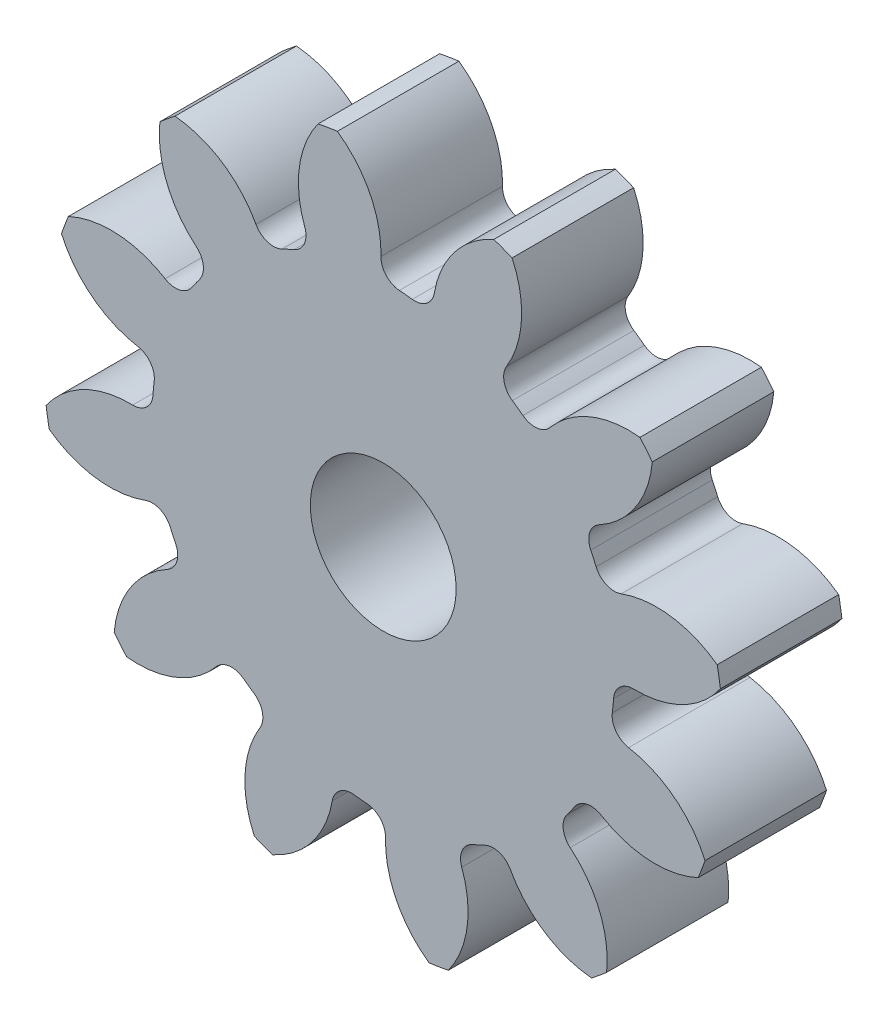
ISO-10303-21;
HEADER;
FILE_DESCRIPTION(('STEP AP214'),'2;1');
FILE_NAME('part.step','',(''),(''),'','','');
FILE_SCHEMA(('AUTOMOTIVE_DESIGN { 1 0 10303 214 1 1 1 1 }'));
ENDSEC;
DATA;
#1=APPLICATION_CONTEXT('core data for automotive mechanical design processes');
#2=APPLICATION_PROTOCOL_DEFINITION('international standard','automotive_design',2000,#1);
#3=PRODUCT_CONTEXT('',#1,'mechanical');
#4=PRODUCT('Part','Part','',(#3));
#5=PRODUCT_RELATED_PRODUCT_CATEGORY('part','',(#4));
#6=PRODUCT_DEFINITION_FORMATION('','',#4);
#7=PRODUCT_DEFINITION_CONTEXT('part definition',#1,'design');
#8=PRODUCT_DEFINITION('design','',#6,#7);
#9=PRODUCT_DEFINITION_SHAPE('','',#8);
#10=(LENGTH_UNIT() NAMED_UNIT(*) SI_UNIT(.MILLI.,.METRE.));
#11=(NAMED_UNIT(*) PLANE_ANGLE_UNIT() SI_UNIT($,.RADIAN.));
#12=(NAMED_UNIT(*) SI_UNIT($,.STERADIAN.) SOLID_ANGLE_UNIT());
#13=UNCERTAINTY_MEASURE_WITH_UNIT(LENGTH_MEASURE(1.E-05),#10,'distance_accuracy_value','');
#14=(GEOMETRIC_REPRESENTATION_CONTEXT(3) GLOBAL_UNCERTAINTY_ASSIGNED_CONTEXT((#13)) GLOBAL_UNIT_ASSIGNED_CONTEXT((#10,
#11,#12)) REPRESENTATION_CONTEXT('',''));
#15=CARTESIAN_POINT('',(0.,0.,0.));
#16=DIRECTION('',(0.,0.,1.));
#17=DIRECTION('',(1.,0.,0.));
#18=AXIS2_PLACEMENT_3D('',#15,#16,#17);
#19=CARTESIAN_POINT('',(0.,0.,127.));
#20=DIRECTION('',(0.,0.,-1.));
#21=DIRECTION('',(-1.,0.,0.));
#22=AXIS2_PLACEMENT_3D('',#19,#20,#21);
#23=CYLINDRICAL_SURFACE('',#22,355.6);
#24=DIRECTION('',(0.,0.,-1.));
#25=VECTOR('',#24,1.);
#26=CARTESIAN_POINT('',(349.028466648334,68.047699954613,63.5));
#27=LINE('',#26,#25);
#28=CARTESIAN_POINT('',(349.028466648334,68.047699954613,127.));
#29=VERTEX_POINT('',#28);
#30=CARTESIAN_POINT('',(349.028466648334,68.047699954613,0.));
#31=VERTEX_POINT('',#30);
#32=EDGE_CURVE('E528',#29,#31,#27,.T.);
#33=ORIENTED_EDGE('',*,*,#32,.F.);
#34=CARTESIAN_POINT('',(0.,0.,127.));
#35=DIRECTION('',(0.,0.,1.));
#36=DIRECTION('',(1.,0.,0.));
#37=AXIS2_PLACEMENT_3D('',#34,#35,#36);
#38=CIRCLE('',#37,355.6);
#39=CARTESIAN_POINT('',(352.35795458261,47.9085779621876,127.));
#40=VERTEX_POINT('',#39);
#41=EDGE_CURVE('E945',#40,#29,#38,.T.);
#42=ORIENTED_EDGE('',*,*,#41,.F.);
#43=DIRECTION('',(0.,0.,-1.));
#44=VECTOR('',#43,1.);
#45=CARTESIAN_POINT('',(352.35795458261,47.9085779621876,63.5));
#46=LINE('',#45,#44);
#47=CARTESIAN_POINT('',(352.35795458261,47.9085779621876,0.));
#48=VERTEX_POINT('',#47);
#49=EDGE_CURVE('E939',#48,#40,#46,.F.);
#50=ORIENTED_EDGE('',*,*,#49,.F.);
#51=CARTESIAN_POINT('',(0.,0.,0.));
#52=DIRECTION('',(0.,0.,1.));
#53=DIRECTION('',(1.,0.,0.));
#54=AXIS2_PLACEMENT_3D('',#51,#52,#53);
#55=CIRCLE('',#54,355.6);
#56=EDGE_CURVE('E950',#48,#31,#55,.T.);
#57=ORIENTED_EDGE('',*,*,#56,.T.);
#58=EDGE_LOOP('',(#33,#42,#50,#57));
#59=FACE_BOUND('',#58,.T.);
#60=ADVANCED_FACE('F33',(#59),#23,.T.);
#61=DIRECTION('',(0.,0.,-1.));
#62=VECTOR('',#61,1.);
#63=CARTESIAN_POINT('',(281.196650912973,217.669022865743,63.5));
#64=LINE('',#63,#62);
#65=CARTESIAN_POINT('',(281.196650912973,217.669022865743,0.));
#66=VERTEX_POINT('',#65);
#67=CARTESIAN_POINT('',(281.196650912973,217.669022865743,127.));
#68=VERTEX_POINT('',#67);
#69=EDGE_CURVE('E499',#66,#68,#64,.F.);
#70=ORIENTED_EDGE('',*,*,#69,.F.);
#71=CARTESIAN_POINT('',(268.24366878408,233.445270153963,0.));
#72=VERTEX_POINT('',#71);
#73=EDGE_CURVE('E953',#66,#72,#55,.T.);
#74=ORIENTED_EDGE('',*,*,#73,.T.);
#75=DIRECTION('',(0.,0.,-1.));
#76=VECTOR('',#75,1.);
#77=CARTESIAN_POINT('',(268.24366878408,233.445270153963,63.5));
#78=LINE('',#77,#76);
#79=CARTESIAN_POINT('',(268.24366878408,233.445270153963,127.));
#80=VERTEX_POINT('',#79);
#81=EDGE_CURVE('E561',#80,#72,#78,.T.);
#82=ORIENTED_EDGE('',*,*,#81,.F.);
#83=EDGE_CURVE('E948',#68,#80,#38,.T.);
#84=ORIENTED_EDGE('',*,*,#83,.F.);
#85=EDGE_LOOP('',(#70,#74,#82,#84));
#86=FACE_BOUND('',#85,.T.);
#87=ADVANCED_FACE('F1091',(#86),#23,.T.);
#88=CARTESIAN_POINT('',(0.,0.,127.));
#89=DIRECTION('',(0.,0.,1.));
#90=DIRECTION('',(1.,0.,0.));
#91=AXIS2_PLACEMENT_3D('',#88,#89,#90);
#92=PLANE('',#91);
#93=CARTESIAN_POINT('',(0.,0.,127.000000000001));
#94=DIRECTION('',(0.,0.,1.));
#95=DIRECTION('',(1.,0.,0.));
#96=AXIS2_PLACEMENT_3D('',#93,#94,#95);
#97=CIRCLE('',#96,76.2);
#98=CARTESIAN_POINT('',(76.2,0.,127.000000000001));
#99=VERTEX_POINT('',#98);
#100=EDGE_CURVE('E516',#99,#99,#97,.T.);
#101=ORIENTED_EDGE('',*,*,#100,.F.);
#102=EDGE_LOOP('',(#101));
#103=FACE_BOUND('',#102,.T.);
#104=ORIENTED_EDGE('',*,*,#41,.T.);
#105=CARTESIAN_POINT('',(285.813199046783,-18.6081708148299,127.));
#106=DIRECTION('',(0.,0.,-1.));
#107=DIRECTION('',(0.866025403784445,0.499999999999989,0.));
#108=AXIS2_PLACEMENT_3D('',#105,#106,#107);
#109=CIRCLE('',#108,107.263274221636);
#110=CARTESIAN_POINT('',(248.698357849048,82.0292902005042,127.));
#111=VERTEX_POINT('',#110);
#112=EDGE_CURVE('E508',#111,#29,#109,.T.);
#113=ORIENTED_EDGE('',*,*,#112,.F.);
#114=CARTESIAN_POINT('',(241.544263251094,101.427727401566,127.));
#115=DIRECTION('',(0.,0.,1.));
#116=DIRECTION('',(-0.866025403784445,-0.499999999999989,0.));
#117=AXIS2_PLACEMENT_3D('',#114,#115,#116);
#118=CIRCLE('',#117,20.6756);
#119=CARTESIAN_POINT('',(222.481142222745,93.4228631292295,127.));
#120=VERTEX_POINT('',#119);
#121=EDGE_CURVE('E506',#120,#111,#118,.T.);
#122=ORIENTED_EDGE('',*,*,#121,.F.);
#123=CARTESIAN_POINT('',(0.,0.,127.));
#124=DIRECTION('',(0.,0.,-1.));
#125=DIRECTION('',(0.866025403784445,0.499999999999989,0.));
#126=AXIS2_PLACEMENT_3D('',#123,#124,#125);
#127=CIRCLE('',#126,241.3);
#128=CARTESIAN_POINT('',(216.884992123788,105.766678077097,127.));
#129=VERTEX_POINT('',#128);
#130=EDGE_CURVE('E491',#129,#120,#127,.T.);
#131=ORIENTED_EDGE('',*,*,#130,.F.);
#132=CARTESIAN_POINT('',(235.468611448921,114.829212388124,127.));
#133=DIRECTION('',(0.,0.,1.));
#134=DIRECTION('',(-0.866025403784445,-0.499999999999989,0.));
#135=AXIS2_PLACEMENT_3D('',#132,#133,#134);
#136=CIRCLE('',#135,20.6756);
#137=CARTESIAN_POINT('',(225.593204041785,132.993924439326,127.));
#138=VERTEX_POINT('',#137);
#139=EDGE_CURVE('E483',#138,#129,#136,.T.);
#140=ORIENTED_EDGE('',*,*,#139,.F.);
#141=CARTESIAN_POINT('',(174.360420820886,227.230923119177,127.));
#142=DIRECTION('',(0.,0.,-1.));
#143=DIRECTION('',(-0.866025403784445,-0.499999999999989,0.));
#144=AXIS2_PLACEMENT_3D('',#141,#142,#143);
#145=CIRCLE('',#144,107.263274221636);
#146=EDGE_CURVE('E513',#68,#138,#145,.T.);
#147=ORIENTED_EDGE('',*,*,#146,.F.);
#148=ORIENTED_EDGE('',*,*,#83,.T.);
#149=CARTESIAN_POINT('',(256.825576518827,126.791450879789,127.));
#150=DIRECTION('',(0.,0.,-1.));
#151=DIRECTION('',(0.50000000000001,0.866025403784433,0.));
#152=AXIS2_PLACEMENT_3D('',#149,#150,#151);
#153=CIRCLE('',#152,107.263274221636);
#154=CARTESIAN_POINT('',(174.364450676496,195.388628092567,127.));
#155=VERTEX_POINT('',#154);
#156=EDGE_CURVE('E537',#155,#80,#153,.T.);
#157=ORIENTED_EDGE('',*,*,#156,.F.);
#158=CARTESIAN_POINT('',(158.46960441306,208.611120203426,127.));
#159=DIRECTION('',(0.,0.,1.));
#160=DIRECTION('',(-0.50000000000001,-0.866025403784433,0.));
#161=AXIS2_PLACEMENT_3D('',#158,#159,#160);
#162=CIRCLE('',#161,20.6756);
#163=CARTESIAN_POINT('',(145.962889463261,192.147143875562,127.));
#164=VERTEX_POINT('',#163);
#165=EDGE_CURVE('E535',#164,#155,#162,.T.);
#166=ORIENTED_EDGE('',*,*,#165,.F.);
#167=CARTESIAN_POINT('',(0.,0.,127.));
#168=DIRECTION('',(0.,0.,-1.));
#169=DIRECTION('',(0.50000000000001,0.866025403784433,0.));
#170=AXIS2_PLACEMENT_3D('',#167,#168,#169);
#171=CIRCLE('',#170,241.3);
#172=CARTESIAN_POINT('',(134.94457384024,200.039126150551,127.));
#173=VERTEX_POINT('',#172);
#174=EDGE_CURVE('E532',#173,#164,#171,.T.);
#175=ORIENTED_EDGE('',*,*,#174,.F.);
#176=CARTESIAN_POINT('',(146.507193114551,217.179320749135,127.));
#177=DIRECTION('',(0.,0.,1.));
#178=DIRECTION('',(-0.50000000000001,-0.866025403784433,0.));
#179=AXIS2_PLACEMENT_3D('',#176,#177,#178);
#180=CIRCLE('',#179,20.6756);
#181=CARTESIAN_POINT('',(128.872483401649,227.972719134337,127.));
#182=VERTEX_POINT('',#181);
#183=EDGE_CURVE('E530',#182,#173,#180,.T.);
#184=ORIENTED_EDGE('',*,*,#183,.F.);
#185=CARTESIAN_POINT('',(37.3850922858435,283.96796235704,127.));
#186=DIRECTION('',(0.,0.,-1.));
#187=DIRECTION('',(-0.50000000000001,-0.866025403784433,0.));
#188=AXIS2_PLACEMENT_3D('',#185,#186,#187);
#189=CIRCLE('',#188,107.263274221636);
#190=CARTESIAN_POINT('',(134.688931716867,329.105228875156,127.));
#191=VERTEX_POINT('',#190);
#192=EDGE_CURVE('E540',#191,#182,#189,.T.);
#193=ORIENTED_EDGE('',*,*,#192,.F.);
#194=CARTESIAN_POINT('',(115.58319649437,336.291368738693,127.));
#195=VERTEX_POINT('',#194);
#196=EDGE_CURVE('E985',#191,#195,#38,.T.);
#197=ORIENTED_EDGE('',*,*,#196,.T.);
#198=CARTESIAN_POINT('',(159.021748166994,238.217405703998,127.));
#199=DIRECTION('',(0.,0.,-1.));
#200=DIRECTION('',(0.,1.,0.));
#201=AXIS2_PLACEMENT_3D('',#198,#199,#200);
#202=CIRCLE('',#201,107.263274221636);
#203=CARTESIAN_POINT('',(53.3097297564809,256.393740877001,127.));
#204=VERTEX_POINT('',#203);
#205=EDGE_CURVE('E572',#204,#195,#202,.T.);
#206=ORIENTED_EDGE('',*,*,#205,.F.);
#207=CARTESIAN_POINT('',(32.9331430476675,259.897331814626,127.));
#208=DIRECTION('',(0.,0.,1.));
#209=DIRECTION('',(0.,-1.,0.));
#210=AXIS2_PLACEMENT_3D('',#207,#208,#209);
#211=CIRCLE('',#210,20.6756);
#212=CARTESIAN_POINT('',(30.3339983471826,239.385752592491,127.));
#213=VERTEX_POINT('',#212);
#214=EDGE_CURVE('E570',#213,#204,#211,.T.);
#215=ORIENTED_EDGE('',*,*,#214,.F.);
#216=CARTESIAN_POINT('',(0.,0.,127.));
#217=DIRECTION('',(0.,0.,-1.));
#218=DIRECTION('',(0.,1.,0.));
#219=AXIS2_PLACEMENT_3D('',#216,#217,#218);
#220=CIRCLE('',#219,241.3);
#221=CARTESIAN_POINT('',(16.8458659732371,240.711251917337,127.));
#222=VERTEX_POINT('',#221);
#223=EDGE_CURVE('E567',#222,#213,#220,.T.);
#224=ORIENTED_EDGE('',*,*,#223,.F.);
#225=CARTESIAN_POINT('',(18.2892906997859,261.336405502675,127.));
#226=DIRECTION('',(0.,0.,1.));
#227=DIRECTION('',(0.,-1.,0.));
#228=AXIS2_PLACEMENT_3D('',#225,#226,#227);
#229=CIRCLE('',#228,20.6756);
#230=CARTESIAN_POINT('',(-2.37951509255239,261.866407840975,127.));
#231=VERTEX_POINT('',#230);
#232=EDGE_CURVE('E565',#231,#222,#229,.T.);
#233=ORIENTED_EDGE('',*,*,#232,.F.);
#234=CARTESIAN_POINT('',(-109.607541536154,264.616015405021,127.));
#235=DIRECTION('',(0.,0.,-1.));
#236=DIRECTION('',(0.,-1.,0.));
#237=AXIS2_PLACEMENT_3D('',#234,#235,#236);
#238=CIRCLE('',#237,107.263274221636);
#239=CARTESIAN_POINT('',(-47.9085779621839,352.357954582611,127.));
#240=VERTEX_POINT('',#239);
#241=EDGE_CURVE('E575',#240,#231,#238,.T.);
#242=ORIENTED_EDGE('',*,*,#241,.F.);
#243=CARTESIAN_POINT('',(-68.0476999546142,349.028466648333,127.));
#244=VERTEX_POINT('',#243);
#245=EDGE_CURVE('E1073',#240,#244,#38,.T.);
#246=ORIENTED_EDGE('',*,*,#245,.T.);
#247=CARTESIAN_POINT('',(18.6081708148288,285.813199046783,127.));
#248=DIRECTION('',(0.,0.,-1.));
#249=DIRECTION('',(-0.499999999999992,0.866025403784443,0.));
#250=AXIS2_PLACEMENT_3D('',#247,#248,#249);
#251=CIRCLE('',#250,107.263274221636);
#252=CARTESIAN_POINT('',(-82.0292902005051,248.698357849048,127.));
#253=VERTEX_POINT('',#252);
#254=EDGE_CURVE('E610',#253,#244,#251,.T.);
#255=ORIENTED_EDGE('',*,*,#254,.F.);
#256=CARTESIAN_POINT('',(-101.427727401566,241.544263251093,127.));
#257=DIRECTION('',(0.,0.,1.));
#258=DIRECTION('',(0.499999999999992,-0.866025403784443,0.));
#259=AXIS2_PLACEMENT_3D('',#256,#257,#258);
#260=CIRCLE('',#259,20.6756);
#261=CARTESIAN_POINT('',(-93.4228631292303,222.481142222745,127.));
#262=VERTEX_POINT('',#261);
#263=EDGE_CURVE('E608',#262,#253,#260,.T.);
#264=ORIENTED_EDGE('',*,*,#263,.F.);
#265=CARTESIAN_POINT('',(0.,0.,127.));
#266=DIRECTION('',(0.,0.,-1.));
#267=DIRECTION('',(-0.499999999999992,0.866025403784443,0.));
#268=AXIS2_PLACEMENT_3D('',#265,#266,#267);
#269=CIRCLE('',#268,241.3);
#270=CARTESIAN_POINT('',(-105.766678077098,216.884992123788,127.));
#271=VERTEX_POINT('',#270);
#272=EDGE_CURVE('E605',#271,#262,#269,.T.);
#273=ORIENTED_EDGE('',*,*,#272,.F.);
#274=CARTESIAN_POINT('',(-114.829212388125,235.468611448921,127.));
#275=DIRECTION('',(0.,0.,1.));
#276=DIRECTION('',(0.499999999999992,-0.866025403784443,0.));
#277=AXIS2_PLACEMENT_3D('',#274,#275,#276);
#278=CIRCLE('',#277,20.6756);
#279=CARTESIAN_POINT('',(-132.993924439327,225.593204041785,127.));
#280=VERTEX_POINT('',#279);
#281=EDGE_CURVE('E603',#280,#271,#278,.T.);
#282=ORIENTED_EDGE('',*,*,#281,.F.);
#283=CARTESIAN_POINT('',(-227.230923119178,174.360420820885,127.));
#284=DIRECTION('',(0.,0.,-1.));
#285=DIRECTION('',(0.499999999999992,-0.866025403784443,0.));
#286=AXIS2_PLACEMENT_3D('',#283,#284,#285);
#287=CIRCLE('',#286,107.263274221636);
#288=CARTESIAN_POINT('',(-217.669022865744,281.196650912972,127.));
#289=VERTEX_POINT('',#288);
#290=EDGE_CURVE('E613',#289,#280,#287,.T.);
#291=ORIENTED_EDGE('',*,*,#290,.F.);
#292=CARTESIAN_POINT('',(-233.445270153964,268.243668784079,127.));
#293=VERTEX_POINT('',#292);
#294=EDGE_CURVE('E1069',#289,#293,#38,.T.);
#295=ORIENTED_EDGE('',*,*,#294,.T.);
#296=CARTESIAN_POINT('',(-126.79145087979,256.825576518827,127.));
#297=DIRECTION('',(0.,0.,-1.));
#298=DIRECTION('',(-0.866025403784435,0.500000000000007,0.));
#299=AXIS2_PLACEMENT_3D('',#296,#297,#298);
#300=CIRCLE('',#299,107.263274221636);
#301=CARTESIAN_POINT('',(-195.388628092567,174.364450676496,127.));
#302=VERTEX_POINT('',#301);
#303=EDGE_CURVE('E648',#302,#293,#300,.T.);
#304=ORIENTED_EDGE('',*,*,#303,.F.);
#305=CARTESIAN_POINT('',(-208.611120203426,158.469604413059,127.));
#306=DIRECTION('',(0.,0.,1.));
#307=DIRECTION('',(0.866025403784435,-0.500000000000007,0.));
#308=AXIS2_PLACEMENT_3D('',#305,#306,#307);
#309=CIRCLE('',#308,20.6756);
#310=CARTESIAN_POINT('',(-192.147143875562,145.96288946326,127.));
#311=VERTEX_POINT('',#310);
#312=EDGE_CURVE('E646',#311,#302,#309,.T.);
#313=ORIENTED_EDGE('',*,*,#312,.F.);
#314=CARTESIAN_POINT('',(0.,0.,127.));
#315=DIRECTION('',(0.,0.,-1.));
#316=DIRECTION('',(-0.866025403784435,0.500000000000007,0.));
#317=AXIS2_PLACEMENT_3D('',#314,#315,#316);
#318=CIRCLE('',#317,241.3);
#319=CARTESIAN_POINT('',(-200.039126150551,134.944573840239,127.));
#320=VERTEX_POINT('',#319);
#321=EDGE_CURVE('E643',#320,#311,#318,.T.);
#322=ORIENTED_EDGE('',*,*,#321,.F.);
#323=CARTESIAN_POINT('',(-217.179320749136,146.50719311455,127.));
#324=DIRECTION('',(0.,0.,1.));
#325=DIRECTION('',(0.866025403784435,-0.500000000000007,0.));
#326=AXIS2_PLACEMENT_3D('',#323,#324,#325);
#327=CIRCLE('',#326,20.6756);
#328=CARTESIAN_POINT('',(-227.972719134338,128.872483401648,127.));
#329=VERTEX_POINT('',#328);
#330=EDGE_CURVE('E641',#329,#320,#327,.T.);
#331=ORIENTED_EDGE('',*,*,#330,.F.);
#332=CARTESIAN_POINT('',(-283.96796235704,37.3850922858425,127.));
#333=DIRECTION('',(0.,0.,-1.));
#334=DIRECTION('',(0.866025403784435,-0.500000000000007,0.));
#335=AXIS2_PLACEMENT_3D('',#332,#333,#334);
#336=CIRCLE('',#335,107.263274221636);
#337=CARTESIAN_POINT('',(-329.105228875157,134.688931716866,127.));
#338=VERTEX_POINT('',#337);
#339=EDGE_CURVE('E651',#338,#329,#336,.T.);
#340=ORIENTED_EDGE('',*,*,#339,.F.);
#341=CARTESIAN_POINT('',(-336.291368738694,115.583196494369,127.));
#342=VERTEX_POINT('',#341);
#343=EDGE_CURVE('E1065',#338,#342,#38,.T.);
#344=ORIENTED_EDGE('',*,*,#343,.T.);
#345=CARTESIAN_POINT('',(-238.217405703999,159.021748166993,127.));
#346=DIRECTION('',(0.,0.,-1.));
#347=DIRECTION('',(-1.,0.,0.));
#348=AXIS2_PLACEMENT_3D('',#345,#346,#347);
#349=CIRCLE('',#348,107.263274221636);
#350=CARTESIAN_POINT('',(-256.393740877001,53.30972975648,127.));
#351=VERTEX_POINT('',#350);
#352=EDGE_CURVE('E686',#351,#342,#349,.T.);
#353=ORIENTED_EDGE('',*,*,#352,.F.);
#354=CARTESIAN_POINT('',(-259.897331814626,32.9331430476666,127.));
#355=DIRECTION('',(0.,0.,1.));
#356=DIRECTION('',(1.,0.,0.));
#357=AXIS2_PLACEMENT_3D('',#354,#355,#356);
#358=CIRCLE('',#357,20.6756);
#359=CARTESIAN_POINT('',(-239.385752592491,30.3339983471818,127.));
#360=VERTEX_POINT('',#359);
#361=EDGE_CURVE('E684',#360,#351,#358,.T.);
#362=ORIENTED_EDGE('',*,*,#361,.F.);
#363=CARTESIAN_POINT('',(0.,0.,127.));
#364=DIRECTION('',(0.,0.,-1.));
#365=DIRECTION('',(-1.,0.,0.));
#366=AXIS2_PLACEMENT_3D('',#363,#364,#365);
#367=CIRCLE('',#366,241.3);
#368=CARTESIAN_POINT('',(-240.711251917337,16.8458659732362,127.));
#369=VERTEX_POINT('',#368);
#370=EDGE_CURVE('E681',#369,#360,#367,.T.);
#371=ORIENTED_EDGE('',*,*,#370,.F.);
#372=CARTESIAN_POINT('',(-261.336405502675,18.289290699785,127.));
#373=DIRECTION('',(0.,0.,1.));
#374=DIRECTION('',(1.,0.,0.));
#375=AXIS2_PLACEMENT_3D('',#372,#373,#374);
#376=CIRCLE('',#375,20.6756);
#377=CARTESIAN_POINT('',(-261.866407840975,-2.3795150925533,127.));
#378=VERTEX_POINT('',#377);
#379=EDGE_CURVE('E679',#378,#369,#376,.T.);
#380=ORIENTED_EDGE('',*,*,#379,.F.);
#381=CARTESIAN_POINT('',(-264.616015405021,-109.607541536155,127.));
#382=DIRECTION('',(0.,0.,-1.));
#383=DIRECTION('',(1.,0.,0.));
#384=AXIS2_PLACEMENT_3D('',#381,#382,#383);
#385=CIRCLE('',#384,107.263274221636);
#386=CARTESIAN_POINT('',(-352.357954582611,-47.9085779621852,127.));
#387=VERTEX_POINT('',#386);
#388=EDGE_CURVE('E689',#387,#378,#385,.T.);
#389=ORIENTED_EDGE('',*,*,#388,.F.);
#390=CARTESIAN_POINT('',(-349.028466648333,-68.0476999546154,127.));
#391=VERTEX_POINT('',#390);
#392=EDGE_CURVE('E1061',#387,#391,#38,.T.);
#393=ORIENTED_EDGE('',*,*,#392,.T.);
#394=CARTESIAN_POINT('',(-285.813199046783,18.6081708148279,127.));
#395=DIRECTION('',(0.,0.,-1.));
#396=DIRECTION('',(-0.866025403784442,-0.499999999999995,0.));
#397=AXIS2_PLACEMENT_3D('',#394,#395,#396);
#398=CIRCLE('',#397,107.263274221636);
#399=CARTESIAN_POINT('',(-248.698357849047,-82.0292902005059,127.));
#400=VERTEX_POINT('',#399);
#401=EDGE_CURVE('E724',#400,#391,#398,.T.);
#402=ORIENTED_EDGE('',*,*,#401,.F.);
#403=CARTESIAN_POINT('',(-241.544263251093,-101.427727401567,127.));
#404=DIRECTION('',(0.,0.,1.));
#405=DIRECTION('',(0.866025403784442,0.499999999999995,0.));
#406=AXIS2_PLACEMENT_3D('',#403,#404,#405);
#407=CIRCLE('',#406,20.6756);
#408=CARTESIAN_POINT('',(-222.481142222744,-93.422863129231,127.));
#409=VERTEX_POINT('',#408);
#410=EDGE_CURVE('E722',#409,#400,#407,.T.);
#411=ORIENTED_EDGE('',*,*,#410,.F.);
#412=CARTESIAN_POINT('',(0.,0.,127.));
#413=DIRECTION('',(0.,0.,-1.));
#414=DIRECTION('',(-0.866025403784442,-0.499999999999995,0.));
#415=AXIS2_PLACEMENT_3D('',#412,#413,#414);
#416=CIRCLE('',#415,241.3);
#417=CARTESIAN_POINT('',(-216.884992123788,-105.766678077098,127.));
#418=VERTEX_POINT('',#417);
#419=EDGE_CURVE('E719',#418,#409,#416,.T.);
#420=ORIENTED_EDGE('',*,*,#419,.F.);
#421=CARTESIAN_POINT('',(-235.468611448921,-114.829212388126,127.));
#422=DIRECTION('',(0.,0.,1.));
#423=DIRECTION('',(0.866025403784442,0.499999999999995,0.));
#424=AXIS2_PLACEMENT_3D('',#421,#422,#423);
#425=CIRCLE('',#424,20.6756);
#426=CARTESIAN_POINT('',(-225.593204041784,-132.993924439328,127.));
#427=VERTEX_POINT('',#426);
#428=EDGE_CURVE('E717',#427,#418,#425,.T.);
#429=ORIENTED_EDGE('',*,*,#428,.F.);
#430=CARTESIAN_POINT('',(-174.360420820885,-227.230923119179,127.));
#431=DIRECTION('',(0.,0.,-1.));
#432=DIRECTION('',(0.866025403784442,0.499999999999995,0.));
#433=AXIS2_PLACEMENT_3D('',#430,#431,#432);
#434=CIRCLE('',#433,107.263274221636);
#435=CARTESIAN_POINT('',(-281.196650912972,-217.669022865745,127.));
#436=VERTEX_POINT('',#435);
#437=EDGE_CURVE('E727',#436,#427,#434,.T.);
#438=ORIENTED_EDGE('',*,*,#437,.F.);
#439=CARTESIAN_POINT('',(-268.243668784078,-233.445270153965,127.));
#440=VERTEX_POINT('',#439);
#441=EDGE_CURVE('E1057',#436,#440,#38,.T.);
#442=ORIENTED_EDGE('',*,*,#441,.T.);
#443=CARTESIAN_POINT('',(-256.825576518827,-126.791450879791,127.));
#444=DIRECTION('',(0.,0.,-1.));
#445=DIRECTION('',(-0.500000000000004,-0.866025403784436,0.));
#446=AXIS2_PLACEMENT_3D('',#443,#444,#445);
#447=CIRCLE('',#446,107.263274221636);
#448=CARTESIAN_POINT('',(-174.364450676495,-195.388628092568,127.));
#449=VERTEX_POINT('',#448);
#450=EDGE_CURVE('E762',#449,#440,#447,.T.);
#451=ORIENTED_EDGE('',*,*,#450,.F.);
#452=CARTESIAN_POINT('',(-158.469604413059,-208.611120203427,127.));
#453=DIRECTION('',(0.,0.,1.));
#454=DIRECTION('',(0.500000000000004,0.866025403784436,0.));
#455=AXIS2_PLACEMENT_3D('',#452,#453,#454);
#456=CIRCLE('',#455,20.6756);
#457=CARTESIAN_POINT('',(-145.96288946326,-192.147143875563,127.));
#458=VERTEX_POINT('',#457);
#459=EDGE_CURVE('E760',#458,#449,#456,.T.);
#460=ORIENTED_EDGE('',*,*,#459,.F.);
#461=CARTESIAN_POINT('',(0.,0.,127.));
#462=DIRECTION('',(0.,0.,-1.));
#463=DIRECTION('',(-0.500000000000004,-0.866025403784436,0.));
#464=AXIS2_PLACEMENT_3D('',#461,#462,#463);
#465=CIRCLE('',#464,241.3);
#466=CARTESIAN_POINT('',(-134.944573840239,-200.039126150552,127.));
#467=VERTEX_POINT('',#466);
#468=EDGE_CURVE('E757',#467,#458,#465,.T.);
#469=ORIENTED_EDGE('',*,*,#468,.F.);
#470=CARTESIAN_POINT('',(-146.507193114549,-217.179320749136,127.));
#471=DIRECTION('',(0.,0.,1.));
#472=DIRECTION('',(0.500000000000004,0.866025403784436,0.));
#473=AXIS2_PLACEMENT_3D('',#470,#471,#472);
#474=CIRCLE('',#473,20.6756);
#475=CARTESIAN_POINT('',(-128.872483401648,-227.972719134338,127.));
#476=VERTEX_POINT('',#475);
#477=EDGE_CURVE('E755',#476,#467,#474,.T.);
#478=ORIENTED_EDGE('',*,*,#477,.F.);
#479=CARTESIAN_POINT('',(-37.3850922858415,-283.96796235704,127.));
#480=DIRECTION('',(0.,0.,-1.));
#481=DIRECTION('',(0.500000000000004,0.866025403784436,0.));
#482=AXIS2_PLACEMENT_3D('',#479,#480,#481);
#483=CIRCLE('',#482,107.263274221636);
#484=CARTESIAN_POINT('',(-134.688931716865,-329.105228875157,127.));
#485=VERTEX_POINT('',#484);
#486=EDGE_CURVE('E765',#485,#476,#483,.T.);
#487=ORIENTED_EDGE('',*,*,#486,.F.);
#488=CARTESIAN_POINT('',(-115.583196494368,-336.291368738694,127.));
#489=VERTEX_POINT('',#488);
#490=EDGE_CURVE('E1053',#485,#489,#38,.T.);
#491=ORIENTED_EDGE('',*,*,#490,.T.);
#492=CARTESIAN_POINT('',(-159.021748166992,-238.217405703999,127.));
#493=DIRECTION('',(0.,0.,-1.));
#494=DIRECTION('',(0.,-1.,0.));
#495=AXIS2_PLACEMENT_3D('',#492,#493,#494);
#496=CIRCLE('',#495,107.263274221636);
#497=CARTESIAN_POINT('',(-53.3097297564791,-256.393740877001,127.));
#498=VERTEX_POINT('',#497);
#499=EDGE_CURVE('E800',#498,#489,#496,.T.);
#500=ORIENTED_EDGE('',*,*,#499,.F.);
#501=CARTESIAN_POINT('',(-32.9331430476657,-259.897331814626,127.));
#502=DIRECTION('',(0.,0.,1.));
#503=DIRECTION('',(0.,1.,0.));
#504=AXIS2_PLACEMENT_3D('',#501,#502,#503);
#505=CIRCLE('',#504,20.6756);
#506=CARTESIAN_POINT('',(-30.3339983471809,-239.385752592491,127.));
#507=VERTEX_POINT('',#506);
#508=EDGE_CURVE('E798',#507,#498,#505,.T.);
#509=ORIENTED_EDGE('',*,*,#508,.F.);
#510=CARTESIAN_POINT('',(0.,0.,127.));
#511=DIRECTION('',(0.,0.,-1.));
#512=DIRECTION('',(0.,-1.,0.));
#513=AXIS2_PLACEMENT_3D('',#510,#511,#512);
#514=CIRCLE('',#513,241.3);
#515=CARTESIAN_POINT('',(-16.8458659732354,-240.711251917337,127.));
#516=VERTEX_POINT('',#515);
#517=EDGE_CURVE('E795',#516,#507,#514,.T.);
#518=ORIENTED_EDGE('',*,*,#517,.F.);
#519=CARTESIAN_POINT('',(-18.2892906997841,-261.336405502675,127.));
#520=DIRECTION('',(0.,0.,1.));
#521=DIRECTION('',(0.,1.,0.));
#522=AXIS2_PLACEMENT_3D('',#519,#520,#521);
#523=CIRCLE('',#522,20.6756);
#524=CARTESIAN_POINT('',(2.37951509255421,-261.866407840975,127.));
#525=VERTEX_POINT('',#524);
#526=EDGE_CURVE('E793',#525,#516,#523,.T.);
#527=ORIENTED_EDGE('',*,*,#526,.F.);
#528=CARTESIAN_POINT('',(109.607541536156,-264.61601540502,127.));
#529=DIRECTION('',(0.,0.,-1.));
#530=DIRECTION('',(0.,1.,0.));
#531=AXIS2_PLACEMENT_3D('',#528,#529,#530);
#532=CIRCLE('',#531,107.263274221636);
#533=CARTESIAN_POINT('',(47.9085779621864,-352.357954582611,127.));
#534=VERTEX_POINT('',#533);
#535=EDGE_CURVE('E803',#534,#525,#532,.T.);
#536=ORIENTED_EDGE('',*,*,#535,.F.);
#537=CARTESIAN_POINT('',(68.0476999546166,-349.028466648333,127.));
#538=VERTEX_POINT('',#537);
#539=EDGE_CURVE('E1049',#534,#538,#38,.T.);
#540=ORIENTED_EDGE('',*,*,#539,.T.);
#541=CARTESIAN_POINT('',(-18.6081708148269,-285.813199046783,127.));
#542=DIRECTION('',(0.,0.,-1.));
#543=DIRECTION('',(0.499999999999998,-0.86602540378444,0.));
#544=AXIS2_PLACEMENT_3D('',#541,#542,#543);
#545=CIRCLE('',#544,107.263274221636);
#546=CARTESIAN_POINT('',(82.0292902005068,-248.698357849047,127.));
#547=VERTEX_POINT('',#546);
#548=EDGE_CURVE('E838',#547,#538,#545,.T.);
#549=ORIENTED_EDGE('',*,*,#548,.F.);
#550=CARTESIAN_POINT('',(101.427727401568,-241.544263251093,127.));
#551=DIRECTION('',(0.,0.,1.));
#552=DIRECTION('',(-0.499999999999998,0.86602540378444,0.));
#553=AXIS2_PLACEMENT_3D('',#550,#551,#552);
#554=CIRCLE('',#553,20.6756);
#555=CARTESIAN_POINT('',(93.4228631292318,-222.481142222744,127.));
#556=VERTEX_POINT('',#555);
#557=EDGE_CURVE('E836',#556,#547,#554,.T.);
#558=ORIENTED_EDGE('',*,*,#557,.F.);
#559=CARTESIAN_POINT('',(0.,0.,127.));
#560=DIRECTION('',(0.,0.,-1.));
#561=DIRECTION('',(0.499999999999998,-0.86602540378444,0.));
#562=AXIS2_PLACEMENT_3D('',#559,#560,#561);
#563=CIRCLE('',#562,241.3);
#564=CARTESIAN_POINT('',(105.766678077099,-216.884992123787,127.));
#565=VERTEX_POINT('',#564);
#566=EDGE_CURVE('E833',#565,#556,#563,.T.);
#567=ORIENTED_EDGE('',*,*,#566,.F.);
#568=CARTESIAN_POINT('',(114.829212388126,-235.46861144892,127.));
#569=DIRECTION('',(0.,0.,1.));
#570=DIRECTION('',(-0.499999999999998,0.86602540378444,0.));
#571=AXIS2_PLACEMENT_3D('',#568,#569,#570);
#572=CIRCLE('',#571,20.6756);
#573=CARTESIAN_POINT('',(132.993924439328,-225.593204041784,127.));
#574=VERTEX_POINT('',#573);
#575=EDGE_CURVE('E831',#574,#565,#572,.T.);
#576=ORIENTED_EDGE('',*,*,#575,.F.);
#577=CARTESIAN_POINT('',(227.230923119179,-174.360420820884,127.));
#578=DIRECTION('',(0.,0.,-1.));
#579=DIRECTION('',(-0.499999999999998,0.86602540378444,0.));
#580=AXIS2_PLACEMENT_3D('',#577,#578,#579);
#581=CIRCLE('',#580,107.263274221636);
#582=CARTESIAN_POINT('',(217.669022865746,-281.196650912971,127.));
#583=VERTEX_POINT('',#582);
#584=EDGE_CURVE('E841',#583,#574,#581,.T.);
#585=ORIENTED_EDGE('',*,*,#584,.F.);
#586=CARTESIAN_POINT('',(233.445270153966,-268.243668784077,127.));
#587=VERTEX_POINT('',#586);
#588=EDGE_CURVE('E1048',#583,#587,#38,.T.);
#589=ORIENTED_EDGE('',*,*,#588,.T.);
#590=CARTESIAN_POINT('',(126.791450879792,-256.825576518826,127.));
#591=DIRECTION('',(0.,0.,-1.));
#592=DIRECTION('',(0.866025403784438,-0.500000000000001,0.));
#593=AXIS2_PLACEMENT_3D('',#590,#591,#592);
#594=CIRCLE('',#593,107.263274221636);
#595=CARTESIAN_POINT('',(195.388628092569,-174.364450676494,127.));
#596=VERTEX_POINT('',#595);
#597=EDGE_CURVE('E876',#596,#587,#594,.T.);
#598=ORIENTED_EDGE('',*,*,#597,.F.);
#599=CARTESIAN_POINT('',(208.611120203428,-158.469604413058,127.));
#600=DIRECTION('',(0.,0.,1.));
#601=DIRECTION('',(-0.866025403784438,0.500000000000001,0.));
#602=AXIS2_PLACEMENT_3D('',#599,#600,#601);
#603=CIRCLE('',#602,20.6756);
#604=CARTESIAN_POINT('',(192.147143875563,-145.962889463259,127.));
#605=VERTEX_POINT('',#604);
#606=EDGE_CURVE('E874',#605,#596,#603,.T.);
#607=ORIENTED_EDGE('',*,*,#606,.F.);
#608=CARTESIAN_POINT('',(0.,0.,127.));
#609=DIRECTION('',(0.,0.,-1.));
#610=DIRECTION('',(0.866025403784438,-0.500000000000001,0.));
#611=AXIS2_PLACEMENT_3D('',#608,#609,#610);
#612=CIRCLE('',#611,241.3);
#613=CARTESIAN_POINT('',(200.039126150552,-134.944573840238,127.));
#614=VERTEX_POINT('',#613);
#615=EDGE_CURVE('E871',#614,#605,#612,.T.);
#616=ORIENTED_EDGE('',*,*,#615,.F.);
#617=CARTESIAN_POINT('',(217.179320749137,-146.507193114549,127.));
#618=DIRECTION('',(0.,0.,1.));
#619=DIRECTION('',(-0.866025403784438,0.500000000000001,0.));
#620=AXIS2_PLACEMENT_3D('',#617,#618,#619);
#621=CIRCLE('',#620,20.6756);
#622=CARTESIAN_POINT('',(227.972719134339,-128.872483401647,127.));
#623=VERTEX_POINT('',#622);
#624=EDGE_CURVE('E869',#623,#614,#621,.T.);
#625=ORIENTED_EDGE('',*,*,#624,.F.);
#626=CARTESIAN_POINT('',(283.96796235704,-37.3850922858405,127.));
#627=DIRECTION('',(0.,0.,-1.));
#628=DIRECTION('',(-0.866025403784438,0.500000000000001,0.));
#629=AXIS2_PLACEMENT_3D('',#626,#627,#628);
#630=CIRCLE('',#629,107.263274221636);
#631=CARTESIAN_POINT('',(329.105228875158,-134.688931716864,127.));
#632=VERTEX_POINT('',#631);
#633=EDGE_CURVE('E879',#632,#623,#630,.T.);
#634=ORIENTED_EDGE('',*,*,#633,.F.);
#635=CARTESIAN_POINT('',(336.291368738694,-115.583196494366,127.));
#636=VERTEX_POINT('',#635);
#637=EDGE_CURVE('E949',#632,#636,#38,.T.);
#638=ORIENTED_EDGE('',*,*,#637,.T.);
#639=CARTESIAN_POINT('',(238.217405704,-159.021748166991,127.));
#640=DIRECTION('',(0.,0.,-1.));
#641=DIRECTION('',(1.,0.,0.));
#642=AXIS2_PLACEMENT_3D('',#639,#640,#641);
#643=CIRCLE('',#642,107.263274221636);
#644=CARTESIAN_POINT('',(256.393740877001,-53.3097297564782,127.));
#645=VERTEX_POINT('',#644);
#646=EDGE_CURVE('E914',#645,#636,#643,.T.);
#647=ORIENTED_EDGE('',*,*,#646,.F.);
#648=CARTESIAN_POINT('',(259.897331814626,-32.9331430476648,127.));
#649=DIRECTION('',(0.,0.,1.));
#650=DIRECTION('',(-1.,0.,0.));
#651=AXIS2_PLACEMENT_3D('',#648,#649,#650);
#652=CIRCLE('',#651,20.6756);
#653=CARTESIAN_POINT('',(239.385752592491,-30.3339983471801,127.));
#654=VERTEX_POINT('',#653);
#655=EDGE_CURVE('E912',#654,#645,#652,.T.);
#656=ORIENTED_EDGE('',*,*,#655,.F.);
#657=CARTESIAN_POINT('',(0.,0.,127.));
#658=DIRECTION('',(0.,0.,-1.));
#659=DIRECTION('',(1.,0.,0.));
#660=AXIS2_PLACEMENT_3D('',#657,#658,#659);
#661=CIRCLE('',#660,241.3);
#662=CARTESIAN_POINT('',(240.711251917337,-16.8458659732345,127.));
#663=VERTEX_POINT('',#662);
#664=EDGE_CURVE('E909',#663,#654,#661,.T.);
#665=ORIENTED_EDGE('',*,*,#664,.F.);
#666=CARTESIAN_POINT('',(261.336405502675,-18.2892906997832,127.));
#667=DIRECTION('',(0.,0.,1.));
#668=DIRECTION('',(-1.,0.,0.));
#669=AXIS2_PLACEMENT_3D('',#666,#667,#668);
#670=CIRCLE('',#669,20.6756);
#671=CARTESIAN_POINT('',(261.866407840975,2.37951509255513,127.));
#672=VERTEX_POINT('',#671);
#673=EDGE_CURVE('E907',#672,#663,#670,.T.);
#674=ORIENTED_EDGE('',*,*,#673,.F.);
#675=CARTESIAN_POINT('',(264.61601540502,109.607541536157,127.));
#676=DIRECTION('',(0.,0.,-1.));
#677=DIRECTION('',(-1.,0.,0.));
#678=AXIS2_PLACEMENT_3D('',#675,#676,#677);
#679=CIRCLE('',#678,107.263274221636);
#680=EDGE_CURVE('E917',#40,#672,#679,.T.);
#681=ORIENTED_EDGE('',*,*,#680,.F.);
#682=EDGE_LOOP('',(#104,#113,#122,#131,#140,#147,#148,#157,#166,#175,#184,#193,#197,#206,#215,
#224,#233,#242,#246,#255,#264,#273,#282,#291,#295,#304,#313,#322,#331,#340,#344,#353,#362,#371,
#380,#389,#393,#402,#411,#420,#429,#438,#442,#451,#460,#469,#478,#487,#491,#500,#509,#518,#527,
#536,#540,#549,#558,#567,#576,#585,#589,#598,#607,#616,#625,#634,#638,#647,#656,#665,#674,#681));
#683=FACE_BOUND('',#682,.T.);
#684=ADVANCED_FACE('F504',(#103,#683),#92,.T.);
#685=CARTESIAN_POINT('',(0.,0.,0.));
#686=DIRECTION('',(0.,0.,1.));
#687=DIRECTION('',(1.,0.,0.));
#688=AXIS2_PLACEMENT_3D('',#685,#686,#687);
#689=PLANE('',#688);
#690=CARTESIAN_POINT('',(0.,0.,0.));
#691=DIRECTION('',(0.,0.,1.));
#692=DIRECTION('',(1.,0.,0.));
#693=AXIS2_PLACEMENT_3D('',#690,#691,#692);
#694=CIRCLE('',#693,76.2);
#695=CARTESIAN_POINT('',(76.2,0.,-1.77635683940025E-12));
#696=VERTEX_POINT('',#695);
#697=EDGE_CURVE('E36',#696,#696,#694,.T.);
#698=ORIENTED_EDGE('',*,*,#697,.T.);
#699=EDGE_LOOP('',(#698));
#700=FACE_BOUND('',#699,.T.);
#701=CARTESIAN_POINT('',(285.813199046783,-18.6081708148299,0.));
#702=DIRECTION('',(0.,0.,-1.));
#703=DIRECTION('',(0.866025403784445,0.499999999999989,0.));
#704=AXIS2_PLACEMENT_3D('',#701,#702,#703);
#705=CIRCLE('',#704,107.263274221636);
#706=CARTESIAN_POINT('',(248.698357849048,82.0292902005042,0.));
#707=VERTEX_POINT('',#706);
#708=EDGE_CURVE('E492',#707,#31,#705,.T.);
#709=ORIENTED_EDGE('',*,*,#708,.T.);
#710=ORIENTED_EDGE('',*,*,#56,.F.);
#711=CARTESIAN_POINT('',(264.61601540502,109.607541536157,0.));
#712=DIRECTION('',(0.,0.,1.));
#713=DIRECTION('',(1.,0.,0.));
#714=AXIS2_PLACEMENT_3D('',#711,#712,#713);
#715=CIRCLE('',#714,107.263274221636);
#716=CARTESIAN_POINT('',(261.866407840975,2.37951509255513,0.));
#717=VERTEX_POINT('',#716);
#718=EDGE_CURVE('E947',#717,#48,#715,.T.);
#719=ORIENTED_EDGE('',*,*,#718,.F.);
#720=CARTESIAN_POINT('',(261.336405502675,-18.2892906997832,0.));
#721=DIRECTION('',(0.,0.,1.));
#722=DIRECTION('',(-1.,0.,0.));
#723=AXIS2_PLACEMENT_3D('',#720,#721,#722);
#724=CIRCLE('',#723,20.6756);
#725=CARTESIAN_POINT('',(240.711251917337,-16.8458659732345,0.));
#726=VERTEX_POINT('',#725);
#727=EDGE_CURVE('E906',#717,#726,#724,.T.);
#728=ORIENTED_EDGE('',*,*,#727,.T.);
#729=CARTESIAN_POINT('',(0.,0.,0.));
#730=DIRECTION('',(0.,0.,-1.));
#731=DIRECTION('',(1.,0.,0.));
#732=AXIS2_PLACEMENT_3D('',#729,#730,#731);
#733=CIRCLE('',#732,241.3);
#734=CARTESIAN_POINT('',(239.385752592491,-30.3339983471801,0.));
#735=VERTEX_POINT('',#734);
#736=EDGE_CURVE('E922',#726,#735,#733,.T.);
#737=ORIENTED_EDGE('',*,*,#736,.T.);
#738=CARTESIAN_POINT('',(259.897331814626,-32.9331430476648,0.));
#739=DIRECTION('',(0.,0.,1.));
#740=DIRECTION('',(-1.,0.,0.));
#741=AXIS2_PLACEMENT_3D('',#738,#739,#740);
#742=CIRCLE('',#741,20.6756);
#743=CARTESIAN_POINT('',(256.393740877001,-53.3097297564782,0.));
#744=VERTEX_POINT('',#743);
#745=EDGE_CURVE('E925',#735,#744,#742,.T.);
#746=ORIENTED_EDGE('',*,*,#745,.T.);
#747=CARTESIAN_POINT('',(238.217405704,-159.021748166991,0.));
#748=DIRECTION('',(0.,0.,-1.));
#749=DIRECTION('',(1.,0.,0.));
#750=AXIS2_PLACEMENT_3D('',#747,#748,#749);
#751=CIRCLE('',#750,107.263274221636);
#752=CARTESIAN_POINT('',(336.291368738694,-115.583196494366,0.));
#753=VERTEX_POINT('',#752);
#754=EDGE_CURVE('E910',#744,#753,#751,.T.);
#755=ORIENTED_EDGE('',*,*,#754,.T.);
#756=CARTESIAN_POINT('',(329.105228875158,-134.688931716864,0.));
#757=VERTEX_POINT('',#756);
#758=EDGE_CURVE('E944',#757,#753,#55,.T.);
#759=ORIENTED_EDGE('',*,*,#758,.F.);
#760=CARTESIAN_POINT('',(283.96796235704,-37.3850922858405,0.));
#761=DIRECTION('',(0.,0.,1.));
#762=DIRECTION('',(1.,0.,0.));
#763=AXIS2_PLACEMENT_3D('',#760,#761,#762);
#764=CIRCLE('',#763,107.263274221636);
#765=CARTESIAN_POINT('',(227.972719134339,-128.872483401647,0.));
#766=VERTEX_POINT('',#765);
#767=EDGE_CURVE('E955',#766,#757,#764,.T.);
#768=ORIENTED_EDGE('',*,*,#767,.F.);
#769=CARTESIAN_POINT('',(217.179320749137,-146.507193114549,0.));
#770=DIRECTION('',(0.,0.,1.));
#771=DIRECTION('',(-0.866025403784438,0.500000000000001,0.));
#772=AXIS2_PLACEMENT_3D('',#769,#770,#771);
#773=CIRCLE('',#772,20.6756);
#774=CARTESIAN_POINT('',(200.039126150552,-134.944573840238,0.));
#775=VERTEX_POINT('',#774);
#776=EDGE_CURVE('E868',#766,#775,#773,.T.);
#777=ORIENTED_EDGE('',*,*,#776,.T.);
#778=CARTESIAN_POINT('',(0.,0.,0.));
#779=DIRECTION('',(0.,0.,-1.));
#780=DIRECTION('',(0.866025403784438,-0.500000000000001,0.));
#781=AXIS2_PLACEMENT_3D('',#778,#779,#780);
#782=CIRCLE('',#781,241.3);
#783=CARTESIAN_POINT('',(192.147143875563,-145.962889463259,0.));
#784=VERTEX_POINT('',#783);
#785=EDGE_CURVE('E884',#775,#784,#782,.T.);
#786=ORIENTED_EDGE('',*,*,#785,.T.);
#787=CARTESIAN_POINT('',(208.611120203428,-158.469604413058,0.));
#788=DIRECTION('',(0.,0.,1.));
#789=DIRECTION('',(-0.866025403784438,0.500000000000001,0.));
#790=AXIS2_PLACEMENT_3D('',#787,#788,#789);
#791=CIRCLE('',#790,20.6756);
#792=CARTESIAN_POINT('',(195.388628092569,-174.364450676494,0.));
#793=VERTEX_POINT('',#792);
#794=EDGE_CURVE('E887',#784,#793,#791,.T.);
#795=ORIENTED_EDGE('',*,*,#794,.T.);
#796=CARTESIAN_POINT('',(126.791450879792,-256.825576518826,0.));
#797=DIRECTION('',(0.,0.,-1.));
#798=DIRECTION('',(0.866025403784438,-0.500000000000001,0.));
#799=AXIS2_PLACEMENT_3D('',#796,#797,#798);
#800=CIRCLE('',#799,107.263274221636);
#801=CARTESIAN_POINT('',(233.445270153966,-268.243668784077,0.));
#802=VERTEX_POINT('',#801);
#803=EDGE_CURVE('E872',#793,#802,#800,.T.);
#804=ORIENTED_EDGE('',*,*,#803,.T.);
#805=CARTESIAN_POINT('',(217.669022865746,-281.196650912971,0.));
#806=VERTEX_POINT('',#805);
#807=EDGE_CURVE('E1019',#806,#802,#55,.T.);
#808=ORIENTED_EDGE('',*,*,#807,.F.);
#809=CARTESIAN_POINT('',(227.230923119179,-174.360420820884,0.));
#810=DIRECTION('',(0.,0.,1.));
#811=DIRECTION('',(1.,0.,0.));
#812=AXIS2_PLACEMENT_3D('',#809,#810,#811);
#813=CIRCLE('',#812,107.263274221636);
#814=CARTESIAN_POINT('',(132.993924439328,-225.593204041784,0.));
#815=VERTEX_POINT('',#814);
#816=EDGE_CURVE('E957',#815,#806,#813,.T.);
#817=ORIENTED_EDGE('',*,*,#816,.F.);
#818=CARTESIAN_POINT('',(114.829212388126,-235.46861144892,0.));
#819=DIRECTION('',(0.,0.,1.));
#820=DIRECTION('',(-0.499999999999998,0.86602540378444,0.));
#821=AXIS2_PLACEMENT_3D('',#818,#819,#820);
#822=CIRCLE('',#821,20.6756);
#823=CARTESIAN_POINT('',(105.766678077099,-216.884992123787,0.));
#824=VERTEX_POINT('',#823);
#825=EDGE_CURVE('E830',#815,#824,#822,.T.);
#826=ORIENTED_EDGE('',*,*,#825,.T.);
#827=CARTESIAN_POINT('',(0.,0.,0.));
#828=DIRECTION('',(0.,0.,-1.));
#829=DIRECTION('',(0.499999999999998,-0.86602540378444,0.));
#830=AXIS2_PLACEMENT_3D('',#827,#828,#829);
#831=CIRCLE('',#830,241.3);
#832=CARTESIAN_POINT('',(93.4228631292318,-222.481142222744,0.));
#833=VERTEX_POINT('',#832);
#834=EDGE_CURVE('E846',#824,#833,#831,.T.);
#835=ORIENTED_EDGE('',*,*,#834,.T.);
#836=CARTESIAN_POINT('',(101.427727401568,-241.544263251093,0.));
#837=DIRECTION('',(0.,0.,1.));
#838=DIRECTION('',(-0.499999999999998,0.86602540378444,0.));
#839=AXIS2_PLACEMENT_3D('',#836,#837,#838);
#840=CIRCLE('',#839,20.6756);
#841=CARTESIAN_POINT('',(82.0292902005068,-248.698357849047,0.));
#842=VERTEX_POINT('',#841);
#843=EDGE_CURVE('E849',#833,#842,#840,.T.);
#844=ORIENTED_EDGE('',*,*,#843,.T.);
#845=CARTESIAN_POINT('',(-18.6081708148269,-285.813199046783,0.));
#846=DIRECTION('',(0.,0.,-1.));
#847=DIRECTION('',(0.499999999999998,-0.86602540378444,0.));
#848=AXIS2_PLACEMENT_3D('',#845,#846,#847);
#849=CIRCLE('',#848,107.263274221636);
#850=CARTESIAN_POINT('',(68.0476999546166,-349.028466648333,0.));
#851=VERTEX_POINT('',#850);
#852=EDGE_CURVE('E834',#842,#851,#849,.T.);
#853=ORIENTED_EDGE('',*,*,#852,.T.);
#854=CARTESIAN_POINT('',(47.9085779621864,-352.357954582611,0.));
#855=VERTEX_POINT('',#854);
#856=EDGE_CURVE('E1014',#855,#851,#55,.T.);
#857=ORIENTED_EDGE('',*,*,#856,.F.);
#858=CARTESIAN_POINT('',(109.607541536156,-264.61601540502,0.));
#859=DIRECTION('',(0.,0.,1.));
#860=DIRECTION('',(1.,0.,0.));
#861=AXIS2_PLACEMENT_3D('',#858,#859,#860);
#862=CIRCLE('',#861,107.263274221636);
#863=CARTESIAN_POINT('',(2.37951509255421,-261.866407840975,0.));
#864=VERTEX_POINT('',#863);
#865=EDGE_CURVE('E959',#864,#855,#862,.T.);
#866=ORIENTED_EDGE('',*,*,#865,.F.);
#867=CARTESIAN_POINT('',(-18.2892906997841,-261.336405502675,0.));
#868=DIRECTION('',(0.,0.,1.));
#869=DIRECTION('',(0.,1.,0.));
#870=AXIS2_PLACEMENT_3D('',#867,#868,#869);
#871=CIRCLE('',#870,20.6756);
#872=CARTESIAN_POINT('',(-16.8458659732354,-240.711251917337,0.));
#873=VERTEX_POINT('',#872);
#874=EDGE_CURVE('E792',#864,#873,#871,.T.);
#875=ORIENTED_EDGE('',*,*,#874,.T.);
#876=CARTESIAN_POINT('',(0.,0.,0.));
#877=DIRECTION('',(0.,0.,-1.));
#878=DIRECTION('',(0.,-1.,0.));
#879=AXIS2_PLACEMENT_3D('',#876,#877,#878);
#880=CIRCLE('',#879,241.3);
#881=CARTESIAN_POINT('',(-30.3339983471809,-239.385752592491,0.));
#882=VERTEX_POINT('',#881);
#883=EDGE_CURVE('E808',#873,#882,#880,.T.);
#884=ORIENTED_EDGE('',*,*,#883,.T.);
#885=CARTESIAN_POINT('',(-32.9331430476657,-259.897331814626,0.));
#886=DIRECTION('',(0.,0.,1.));
#887=DIRECTION('',(0.,1.,0.));
#888=AXIS2_PLACEMENT_3D('',#885,#886,#887);
#889=CIRCLE('',#888,20.6756);
#890=CARTESIAN_POINT('',(-53.3097297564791,-256.393740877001,0.));
#891=VERTEX_POINT('',#890);
#892=EDGE_CURVE('E811',#882,#891,#889,.T.);
#893=ORIENTED_EDGE('',*,*,#892,.T.);
#894=CARTESIAN_POINT('',(-159.021748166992,-238.217405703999,0.));
#895=DIRECTION('',(0.,0.,-1.));
#896=DIRECTION('',(0.,-1.,0.));
#897=AXIS2_PLACEMENT_3D('',#894,#895,#896);
#898=CIRCLE('',#897,107.263274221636);
#899=CARTESIAN_POINT('',(-115.583196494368,-336.291368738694,0.));
#900=VERTEX_POINT('',#899);
#901=EDGE_CURVE('E796',#891,#900,#898,.T.);
#902=ORIENTED_EDGE('',*,*,#901,.T.);
#903=CARTESIAN_POINT('',(-134.688931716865,-329.105228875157,0.));
#904=VERTEX_POINT('',#903);
#905=EDGE_CURVE('E1009',#904,#900,#55,.T.);
#906=ORIENTED_EDGE('',*,*,#905,.F.);
#907=CARTESIAN_POINT('',(-37.3850922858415,-283.96796235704,0.));
#908=DIRECTION('',(0.,0.,1.));
#909=DIRECTION('',(1.,0.,0.));
#910=AXIS2_PLACEMENT_3D('',#907,#908,#909);
#911=CIRCLE('',#910,107.263274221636);
#912=CARTESIAN_POINT('',(-128.872483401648,-227.972719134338,0.));
#913=VERTEX_POINT('',#912);
#914=EDGE_CURVE('E961',#913,#904,#911,.T.);
#915=ORIENTED_EDGE('',*,*,#914,.F.);
#916=CARTESIAN_POINT('',(-146.507193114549,-217.179320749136,0.));
#917=DIRECTION('',(0.,0.,1.));
#918=DIRECTION('',(0.500000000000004,0.866025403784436,0.));
#919=AXIS2_PLACEMENT_3D('',#916,#917,#918);
#920=CIRCLE('',#919,20.6756);
#921=CARTESIAN_POINT('',(-134.944573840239,-200.039126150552,0.));
#922=VERTEX_POINT('',#921);
#923=EDGE_CURVE('E754',#913,#922,#920,.T.);
#924=ORIENTED_EDGE('',*,*,#923,.T.);
#925=CARTESIAN_POINT('',(0.,0.,0.));
#926=DIRECTION('',(0.,0.,-1.));
#927=DIRECTION('',(-0.500000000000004,-0.866025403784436,0.));
#928=AXIS2_PLACEMENT_3D('',#925,#926,#927);
#929=CIRCLE('',#928,241.3);
#930=CARTESIAN_POINT('',(-145.96288946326,-192.147143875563,0.));
#931=VERTEX_POINT('',#930);
#932=EDGE_CURVE('E770',#922,#931,#929,.T.);
#933=ORIENTED_EDGE('',*,*,#932,.T.);
#934=CARTESIAN_POINT('',(-158.469604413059,-208.611120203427,0.));
#935=DIRECTION('',(0.,0.,1.));
#936=DIRECTION('',(0.500000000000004,0.866025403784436,0.));
#937=AXIS2_PLACEMENT_3D('',#934,#935,#936);
#938=CIRCLE('',#937,20.6756);
#939=CARTESIAN_POINT('',(-174.364450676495,-195.388628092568,0.));
#940=VERTEX_POINT('',#939);
#941=EDGE_CURVE('E773',#931,#940,#938,.T.);
#942=ORIENTED_EDGE('',*,*,#941,.T.);
#943=CARTESIAN_POINT('',(-256.825576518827,-126.791450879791,0.));
#944=DIRECTION('',(0.,0.,-1.));
#945=DIRECTION('',(-0.500000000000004,-0.866025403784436,0.));
#946=AXIS2_PLACEMENT_3D('',#943,#944,#945);
#947=CIRCLE('',#946,107.263274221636);
#948=CARTESIAN_POINT('',(-268.243668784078,-233.445270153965,0.));
#949=VERTEX_POINT('',#948);
#950=EDGE_CURVE('E758',#940,#949,#947,.T.);
#951=ORIENTED_EDGE('',*,*,#950,.T.);
#952=CARTESIAN_POINT('',(-281.196650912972,-217.669022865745,0.));
#953=VERTEX_POINT('',#952);
#954=EDGE_CURVE('E1004',#953,#949,#55,.T.);
#955=ORIENTED_EDGE('',*,*,#954,.F.);
#956=CARTESIAN_POINT('',(-174.360420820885,-227.230923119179,0.));
#957=DIRECTION('',(0.,0.,1.));
#958=DIRECTION('',(1.,0.,0.));
#959=AXIS2_PLACEMENT_3D('',#956,#957,#958);
#960=CIRCLE('',#959,107.263274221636);
#961=CARTESIAN_POINT('',(-225.593204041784,-132.993924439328,0.));
#962=VERTEX_POINT('',#961);
#963=EDGE_CURVE('E963',#962,#953,#960,.T.);
#964=ORIENTED_EDGE('',*,*,#963,.F.);
#965=CARTESIAN_POINT('',(-235.468611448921,-114.829212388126,0.));
#966=DIRECTION('',(0.,0.,1.));
#967=DIRECTION('',(0.866025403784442,0.499999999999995,0.));
#968=AXIS2_PLACEMENT_3D('',#965,#966,#967);
#969=CIRCLE('',#968,20.6756);
#970=CARTESIAN_POINT('',(-216.884992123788,-105.766678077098,0.));
#971=VERTEX_POINT('',#970);
#972=EDGE_CURVE('E716',#962,#971,#969,.T.);
#973=ORIENTED_EDGE('',*,*,#972,.T.);
#974=CARTESIAN_POINT('',(0.,0.,0.));
#975=DIRECTION('',(0.,0.,-1.));
#976=DIRECTION('',(-0.866025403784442,-0.499999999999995,0.));
#977=AXIS2_PLACEMENT_3D('',#974,#975,#976);
#978=CIRCLE('',#977,241.3);
#979=CARTESIAN_POINT('',(-222.481142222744,-93.422863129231,0.));
#980=VERTEX_POINT('',#979);
#981=EDGE_CURVE('E732',#971,#980,#978,.T.);
#982=ORIENTED_EDGE('',*,*,#981,.T.);
#983=CARTESIAN_POINT('',(-241.544263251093,-101.427727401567,0.));
#984=DIRECTION('',(0.,0.,1.));
#985=DIRECTION('',(0.866025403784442,0.499999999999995,0.));
#986=AXIS2_PLACEMENT_3D('',#983,#984,#985);
#987=CIRCLE('',#986,20.6756);
#988=CARTESIAN_POINT('',(-248.698357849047,-82.0292902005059,0.));
#989=VERTEX_POINT('',#988);
#990=EDGE_CURVE('E735',#980,#989,#987,.T.);
#991=ORIENTED_EDGE('',*,*,#990,.T.);
#992=CARTESIAN_POINT('',(-285.813199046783,18.6081708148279,0.));
#993=DIRECTION('',(0.,0.,-1.));
#994=DIRECTION('',(-0.866025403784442,-0.499999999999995,0.));
#995=AXIS2_PLACEMENT_3D('',#992,#993,#994);
#996=CIRCLE('',#995,107.263274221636);
#997=CARTESIAN_POINT('',(-349.028466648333,-68.0476999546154,0.));
#998=VERTEX_POINT('',#997);
#999=EDGE_CURVE('E720',#989,#998,#996,.T.);
#1000=ORIENTED_EDGE('',*,*,#999,.T.);
#1001=CARTESIAN_POINT('',(-352.357954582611,-47.9085779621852,0.));
#1002=VERTEX_POINT('',#1001);
#1003=EDGE_CURVE('E999',#1002,#998,#55,.T.);
#1004=ORIENTED_EDGE('',*,*,#1003,.F.);
#1005=CARTESIAN_POINT('',(-264.616015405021,-109.607541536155,0.));
#1006=DIRECTION('',(0.,0.,1.));
#1007=DIRECTION('',(1.,0.,0.));
#1008=AXIS2_PLACEMENT_3D('',#1005,#1006,#1007);
#1009=CIRCLE('',#1008,107.263274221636);
#1010=CARTESIAN_POINT('',(-261.866407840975,-2.37951509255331,0.));
#1011=VERTEX_POINT('',#1010);
#1012=EDGE_CURVE('E965',#1011,#1002,#1009,.T.);
#1013=ORIENTED_EDGE('',*,*,#1012,.F.);
#1014=CARTESIAN_POINT('',(-261.336405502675,18.289290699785,0.));
#1015=DIRECTION('',(0.,0.,1.));
#1016=DIRECTION('',(1.,0.,0.));
#1017=AXIS2_PLACEMENT_3D('',#1014,#1015,#1016);
#1018=CIRCLE('',#1017,20.6756);
#1019=CARTESIAN_POINT('',(-240.711251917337,16.8458659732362,0.));
#1020=VERTEX_POINT('',#1019);
#1021=EDGE_CURVE('E678',#1011,#1020,#1018,.T.);
#1022=ORIENTED_EDGE('',*,*,#1021,.T.);
#1023=CARTESIAN_POINT('',(0.,0.,0.));
#1024=DIRECTION('',(0.,0.,-1.));
#1025=DIRECTION('',(-1.,0.,0.));
#1026=AXIS2_PLACEMENT_3D('',#1023,#1024,#1025);
#1027=CIRCLE('',#1026,241.3);
#1028=CARTESIAN_POINT('',(-239.385752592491,30.3339983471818,0.));
#1029=VERTEX_POINT('',#1028);
#1030=EDGE_CURVE('E694',#1020,#1029,#1027,.T.);
#1031=ORIENTED_EDGE('',*,*,#1030,.T.);
#1032=CARTESIAN_POINT('',(-259.897331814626,32.9331430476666,0.));
#1033=DIRECTION('',(0.,0.,1.));
#1034=DIRECTION('',(1.,0.,0.));
#1035=AXIS2_PLACEMENT_3D('',#1032,#1033,#1034);
#1036=CIRCLE('',#1035,20.6756);
#1037=CARTESIAN_POINT('',(-256.393740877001,53.30972975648,0.));
#1038=VERTEX_POINT('',#1037);
#1039=EDGE_CURVE('E697',#1029,#1038,#1036,.T.);
#1040=ORIENTED_EDGE('',*,*,#1039,.T.);
#1041=CARTESIAN_POINT('',(-238.217405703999,159.021748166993,0.));
#1042=DIRECTION('',(0.,0.,-1.));
#1043=DIRECTION('',(-1.,0.,0.));
#1044=AXIS2_PLACEMENT_3D('',#1041,#1042,#1043);
#1045=CIRCLE('',#1044,107.263274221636);
#1046=CARTESIAN_POINT('',(-336.291368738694,115.583196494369,0.));
#1047=VERTEX_POINT('',#1046);
#1048=EDGE_CURVE('E682',#1038,#1047,#1045,.T.);
#1049=ORIENTED_EDGE('',*,*,#1048,.T.);
#1050=CARTESIAN_POINT('',(-329.105228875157,134.688931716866,0.));
#1051=VERTEX_POINT('',#1050);
#1052=EDGE_CURVE('E994',#1051,#1047,#55,.T.);
#1053=ORIENTED_EDGE('',*,*,#1052,.F.);
#1054=CARTESIAN_POINT('',(-283.96796235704,37.3850922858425,0.));
#1055=DIRECTION('',(0.,0.,1.));
#1056=DIRECTION('',(1.,0.,0.));
#1057=AXIS2_PLACEMENT_3D('',#1054,#1055,#1056);
#1058=CIRCLE('',#1057,107.263274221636);
#1059=CARTESIAN_POINT('',(-227.972719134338,128.872483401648,0.));
#1060=VERTEX_POINT('',#1059);
#1061=EDGE_CURVE('E967',#1060,#1051,#1058,.T.);
#1062=ORIENTED_EDGE('',*,*,#1061,.F.);
#1063=CARTESIAN_POINT('',(-217.179320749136,146.50719311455,0.));
#1064=DIRECTION('',(0.,0.,1.));
#1065=DIRECTION('',(0.866025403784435,-0.500000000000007,0.));
#1066=AXIS2_PLACEMENT_3D('',#1063,#1064,#1065);
#1067=CIRCLE('',#1066,20.6756);
#1068=CARTESIAN_POINT('',(-200.039126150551,134.944573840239,0.));
#1069=VERTEX_POINT('',#1068);
#1070=EDGE_CURVE('E640',#1060,#1069,#1067,.T.);
#1071=ORIENTED_EDGE('',*,*,#1070,.T.);
#1072=CARTESIAN_POINT('',(0.,0.,0.));
#1073=DIRECTION('',(0.,0.,-1.));
#1074=DIRECTION('',(-0.866025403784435,0.500000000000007,0.));
#1075=AXIS2_PLACEMENT_3D('',#1072,#1073,#1074);
#1076=CIRCLE('',#1075,241.3);
#1077=CARTESIAN_POINT('',(-192.147143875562,145.96288946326,0.));
#1078=VERTEX_POINT('',#1077);
#1079=EDGE_CURVE('E656',#1069,#1078,#1076,.T.);
#1080=ORIENTED_EDGE('',*,*,#1079,.T.);
#1081=CARTESIAN_POINT('',(-208.611120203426,158.469604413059,0.));
#1082=DIRECTION('',(0.,0.,1.));
#1083=DIRECTION('',(0.866025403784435,-0.500000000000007,0.));
#1084=AXIS2_PLACEMENT_3D('',#1081,#1082,#1083);
#1085=CIRCLE('',#1084,20.6756);
#1086=CARTESIAN_POINT('',(-195.388628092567,174.364450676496,0.));
#1087=VERTEX_POINT('',#1086);
#1088=EDGE_CURVE('E659',#1078,#1087,#1085,.T.);
#1089=ORIENTED_EDGE('',*,*,#1088,.T.);
#1090=CARTESIAN_POINT('',(-126.79145087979,256.825576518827,0.));
#1091=DIRECTION('',(0.,0.,-1.));
#1092=DIRECTION('',(-0.866025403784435,0.500000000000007,0.));
#1093=AXIS2_PLACEMENT_3D('',#1090,#1091,#1092);
#1094=CIRCLE('',#1093,107.263274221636);
#1095=CARTESIAN_POINT('',(-233.445270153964,268.243668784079,0.));
#1096=VERTEX_POINT('',#1095);
#1097=EDGE_CURVE('E644',#1087,#1096,#1094,.T.);
#1098=ORIENTED_EDGE('',*,*,#1097,.T.);
#1099=CARTESIAN_POINT('',(-217.669022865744,281.196650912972,0.));
#1100=VERTEX_POINT('',#1099);
#1101=EDGE_CURVE('E989',#1100,#1096,#55,.T.);
#1102=ORIENTED_EDGE('',*,*,#1101,.F.);
#1103=CARTESIAN_POINT('',(-227.230923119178,174.360420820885,0.));
#1104=DIRECTION('',(0.,0.,1.));
#1105=DIRECTION('',(1.,0.,0.));
#1106=AXIS2_PLACEMENT_3D('',#1103,#1104,#1105);
#1107=CIRCLE('',#1106,107.263274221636);
#1108=CARTESIAN_POINT('',(-132.993924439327,225.593204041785,0.));
#1109=VERTEX_POINT('',#1108);
#1110=EDGE_CURVE('E969',#1109,#1100,#1107,.T.);
#1111=ORIENTED_EDGE('',*,*,#1110,.F.);
#1112=CARTESIAN_POINT('',(-114.829212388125,235.468611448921,0.));
#1113=DIRECTION('',(0.,0.,1.));
#1114=DIRECTION('',(0.499999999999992,-0.866025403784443,0.));
#1115=AXIS2_PLACEMENT_3D('',#1112,#1113,#1114);
#1116=CIRCLE('',#1115,20.6756);
#1117=CARTESIAN_POINT('',(-105.766678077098,216.884992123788,0.));
#1118=VERTEX_POINT('',#1117);
#1119=EDGE_CURVE('E602',#1109,#1118,#1116,.T.);
#1120=ORIENTED_EDGE('',*,*,#1119,.T.);
#1121=CARTESIAN_POINT('',(0.,0.,0.));
#1122=DIRECTION('',(0.,0.,-1.));
#1123=DIRECTION('',(-0.499999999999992,0.866025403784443,0.));
#1124=AXIS2_PLACEMENT_3D('',#1121,#1122,#1123);
#1125=CIRCLE('',#1124,241.3);
#1126=CARTESIAN_POINT('',(-93.4228631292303,222.481142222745,0.));
#1127=VERTEX_POINT('',#1126);
#1128=EDGE_CURVE('E618',#1118,#1127,#1125,.T.);
#1129=ORIENTED_EDGE('',*,*,#1128,.T.);
#1130=CARTESIAN_POINT('',(-101.427727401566,241.544263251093,0.));
#1131=DIRECTION('',(0.,0.,1.));
#1132=DIRECTION('',(0.499999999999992,-0.866025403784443,0.));
#1133=AXIS2_PLACEMENT_3D('',#1130,#1131,#1132);
#1134=CIRCLE('',#1133,20.6756);
#1135=CARTESIAN_POINT('',(-82.0292902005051,248.698357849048,0.));
#1136=VERTEX_POINT('',#1135);
#1137=EDGE_CURVE('E621',#1127,#1136,#1134,.T.);
#1138=ORIENTED_EDGE('',*,*,#1137,.T.);
#1139=CARTESIAN_POINT('',(18.6081708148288,285.813199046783,0.));
#1140=DIRECTION('',(0.,0.,-1.));
#1141=DIRECTION('',(-0.499999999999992,0.866025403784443,0.));
#1142=AXIS2_PLACEMENT_3D('',#1139,#1140,#1141);
#1143=CIRCLE('',#1142,107.263274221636);
#1144=CARTESIAN_POINT('',(-68.0476999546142,349.028466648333,0.));
#1145=VERTEX_POINT('',#1144);
#1146=EDGE_CURVE('E606',#1136,#1145,#1143,.T.);
#1147=ORIENTED_EDGE('',*,*,#1146,.T.);
#1148=CARTESIAN_POINT('',(-47.9085779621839,352.357954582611,0.));
#1149=VERTEX_POINT('',#1148);
#1150=EDGE_CURVE('E988',#1149,#1145,#55,.T.);
#1151=ORIENTED_EDGE('',*,*,#1150,.F.);
#1152=CARTESIAN_POINT('',(-109.607541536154,264.616015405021,0.));
#1153=DIRECTION('',(0.,0.,1.));
#1154=DIRECTION('',(1.,0.,0.));
#1155=AXIS2_PLACEMENT_3D('',#1152,#1153,#1154);
#1156=CIRCLE('',#1155,107.263274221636);
#1157=CARTESIAN_POINT('',(-2.37951509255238,261.866407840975,0.));
#1158=VERTEX_POINT('',#1157);
#1159=EDGE_CURVE('E971',#1158,#1149,#1156,.T.);
#1160=ORIENTED_EDGE('',*,*,#1159,.F.);
#1161=CARTESIAN_POINT('',(18.2892906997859,261.336405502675,0.));
#1162=DIRECTION('',(0.,0.,1.));
#1163=DIRECTION('',(0.,-1.,0.));
#1164=AXIS2_PLACEMENT_3D('',#1161,#1162,#1163);
#1165=CIRCLE('',#1164,20.6756);
#1166=CARTESIAN_POINT('',(16.8458659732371,240.711251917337,0.));
#1167=VERTEX_POINT('',#1166);
#1168=EDGE_CURVE('E564',#1158,#1167,#1165,.T.);
#1169=ORIENTED_EDGE('',*,*,#1168,.T.);
#1170=CARTESIAN_POINT('',(0.,0.,0.));
#1171=DIRECTION('',(0.,0.,-1.));
#1172=DIRECTION('',(0.,1.,0.));
#1173=AXIS2_PLACEMENT_3D('',#1170,#1171,#1172);
#1174=CIRCLE('',#1173,241.3);
#1175=CARTESIAN_POINT('',(30.3339983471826,239.385752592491,0.));
#1176=VERTEX_POINT('',#1175);
#1177=EDGE_CURVE('E580',#1167,#1176,#1174,.T.);
#1178=ORIENTED_EDGE('',*,*,#1177,.T.);
#1179=CARTESIAN_POINT('',(32.9331430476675,259.897331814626,0.));
#1180=DIRECTION('',(0.,0.,1.));
#1181=DIRECTION('',(0.,-1.,0.));
#1182=AXIS2_PLACEMENT_3D('',#1179,#1180,#1181);
#1183=CIRCLE('',#1182,20.6756);
#1184=CARTESIAN_POINT('',(53.3097297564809,256.393740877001,0.));
#1185=VERTEX_POINT('',#1184);
#1186=EDGE_CURVE('E583',#1176,#1185,#1183,.T.);
#1187=ORIENTED_EDGE('',*,*,#1186,.T.);
#1188=CARTESIAN_POINT('',(159.021748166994,238.217405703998,0.));
#1189=DIRECTION('',(0.,0.,-1.));
#1190=DIRECTION('',(0.,1.,0.));
#1191=AXIS2_PLACEMENT_3D('',#1188,#1189,#1190);
#1192=CIRCLE('',#1191,107.263274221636);
#1193=CARTESIAN_POINT('',(115.58319649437,336.291368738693,0.));
#1194=VERTEX_POINT('',#1193);
#1195=EDGE_CURVE('E568',#1185,#1194,#1192,.T.);
#1196=ORIENTED_EDGE('',*,*,#1195,.T.);
#1197=CARTESIAN_POINT('',(134.688931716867,329.105228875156,0.));
#1198=VERTEX_POINT('',#1197);
#1199=EDGE_CURVE('E984',#1198,#1194,#55,.T.);
#1200=ORIENTED_EDGE('',*,*,#1199,.F.);
#1201=CARTESIAN_POINT('',(37.3850922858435,283.96796235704,0.));
#1202=DIRECTION('',(0.,0.,1.));
#1203=DIRECTION('',(1.,0.,0.));
#1204=AXIS2_PLACEMENT_3D('',#1201,#1202,#1203);
#1205=CIRCLE('',#1204,107.263274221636);
#1206=CARTESIAN_POINT('',(128.872483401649,227.972719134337,0.));
#1207=VERTEX_POINT('',#1206);
#1208=EDGE_CURVE('E41',#1207,#1198,#1205,.T.);
#1209=ORIENTED_EDGE('',*,*,#1208,.F.);
#1210=CARTESIAN_POINT('',(146.507193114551,217.179320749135,0.));
#1211=DIRECTION('',(0.,0.,1.));
#1212=DIRECTION('',(-0.50000000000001,-0.866025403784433,0.));
#1213=AXIS2_PLACEMENT_3D('',#1210,#1211,#1212);
#1214=CIRCLE('',#1213,20.6756);
#1215=CARTESIAN_POINT('',(134.94457384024,200.039126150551,0.));
#1216=VERTEX_POINT('',#1215);
#1217=EDGE_CURVE('E56',#1207,#1216,#1214,.T.);
#1218=ORIENTED_EDGE('',*,*,#1217,.T.);
#1219=CARTESIAN_POINT('',(0.,0.,0.));
#1220=DIRECTION('',(0.,0.,-1.));
#1221=DIRECTION('',(0.50000000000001,0.866025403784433,0.));
#1222=AXIS2_PLACEMENT_3D('',#1219,#1220,#1221);
#1223=CIRCLE('',#1222,241.3);
#1224=CARTESIAN_POINT('',(145.962889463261,192.147143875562,0.));
#1225=VERTEX_POINT('',#1224);
#1226=EDGE_CURVE('E544',#1216,#1225,#1223,.T.);
#1227=ORIENTED_EDGE('',*,*,#1226,.T.);
#1228=CARTESIAN_POINT('',(158.46960441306,208.611120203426,0.));
#1229=DIRECTION('',(0.,0.,1.));
#1230=DIRECTION('',(-0.50000000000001,-0.866025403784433,0.));
#1231=AXIS2_PLACEMENT_3D('',#1228,#1229,#1230);
#1232=CIRCLE('',#1231,20.6756);
#1233=CARTESIAN_POINT('',(174.364450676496,195.388628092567,0.));
#1234=VERTEX_POINT('',#1233);
#1235=EDGE_CURVE('E547',#1225,#1234,#1232,.T.);
#1236=ORIENTED_EDGE('',*,*,#1235,.T.);
#1237=CARTESIAN_POINT('',(256.825576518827,126.791450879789,0.));
#1238=DIRECTION('',(0.,0.,-1.));
#1239=DIRECTION('',(0.50000000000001,0.866025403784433,0.));
#1240=AXIS2_PLACEMENT_3D('',#1237,#1238,#1239);
#1241=CIRCLE('',#1240,107.263274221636);
#1242=EDGE_CURVE('E533',#1234,#72,#1241,.T.);
#1243=ORIENTED_EDGE('',*,*,#1242,.T.);
#1244=ORIENTED_EDGE('',*,*,#73,.F.);
#1245=CARTESIAN_POINT('',(174.360420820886,227.230923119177,0.));
#1246=DIRECTION('',(0.,0.,1.));
#1247=DIRECTION('',(1.,0.,0.));
#1248=AXIS2_PLACEMENT_3D('',#1245,#1246,#1247);
#1249=CIRCLE('',#1248,107.263274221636);
#1250=CARTESIAN_POINT('',(225.593204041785,132.993924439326,0.));
#1251=VERTEX_POINT('',#1250);
#1252=EDGE_CURVE('E11',#1251,#66,#1249,.T.);
#1253=ORIENTED_EDGE('',*,*,#1252,.F.);
#1254=CARTESIAN_POINT('',(235.468611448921,114.829212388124,0.));
#1255=DIRECTION('',(0.,0.,1.));
#1256=DIRECTION('',(-0.866025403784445,-0.499999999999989,0.));
#1257=AXIS2_PLACEMENT_3D('',#1254,#1255,#1256);
#1258=CIRCLE('',#1257,20.6756);
#1259=CARTESIAN_POINT('',(216.884992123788,105.766678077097,0.));
#1260=VERTEX_POINT('',#1259);
#1261=EDGE_CURVE('E48',#1251,#1260,#1258,.T.);
#1262=ORIENTED_EDGE('',*,*,#1261,.T.);
#1263=CARTESIAN_POINT('',(0.,0.,0.));
#1264=DIRECTION('',(0.,0.,-1.));
#1265=DIRECTION('',(0.866025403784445,0.499999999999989,0.));
#1266=AXIS2_PLACEMENT_3D('',#1263,#1264,#1265);
#1267=CIRCLE('',#1266,241.3);
#1268=CARTESIAN_POINT('',(222.481142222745,93.4228631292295,0.));
#1269=VERTEX_POINT('',#1268);
#1270=EDGE_CURVE('E498',#1260,#1269,#1267,.T.);
#1271=ORIENTED_EDGE('',*,*,#1270,.T.);
#1272=CARTESIAN_POINT('',(241.544263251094,101.427727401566,0.));
#1273=DIRECTION('',(0.,0.,1.));
#1274=DIRECTION('',(-0.866025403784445,-0.499999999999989,0.));
#1275=AXIS2_PLACEMENT_3D('',#1272,#1273,#1274);
#1276=CIRCLE('',#1275,20.6756);
#1277=EDGE_CURVE('E518',#1269,#707,#1276,.T.);
#1278=ORIENTED_EDGE('',*,*,#1277,.T.);
#1279=EDGE_LOOP('',(#709,#710,#719,#728,#737,#746,#755,#759,#768,#777,#786,#795,#804,#808,#817,
#826,#835,#844,#853,#857,#866,#875,#884,#893,#902,#906,#915,#924,#933,#942,#951,#955,#964,#973,
#982,#991,#1000,#1004,#1013,#1022,#1031,#1040,#1049,#1053,#1062,#1071,#1080,#1089,#1098,#1102,
#1111,#1120,#1129,#1138,#1147,#1151,#1160,#1169,#1178,#1187,#1196,#1200,#1209,#1218,#1227,#1236,
#1243,#1244,#1253,#1262,#1271,#1278));
#1280=FACE_BOUND('',#1279,.T.);
#1281=ADVANCED_FACE('F986',(#700,#1280),#689,.F.);
#1282=DIRECTION('',(0.,0.,-1.));
#1283=VECTOR('',#1282,1.);
#1284=CARTESIAN_POINT('',(134.688931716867,329.105228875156,63.5));
#1285=LINE('',#1284,#1283);
#1286=EDGE_CURVE('E559',#1198,#191,#1285,.F.);
#1287=ORIENTED_EDGE('',*,*,#1286,.F.);
#1288=ORIENTED_EDGE('',*,*,#1199,.T.);
#1289=DIRECTION('',(0.,0.,-1.));
#1290=VECTOR('',#1289,1.);
#1291=CARTESIAN_POINT('',(115.58319649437,336.291368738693,63.5));
#1292=LINE('',#1291,#1290);
#1293=EDGE_CURVE('E599',#195,#1194,#1292,.T.);
#1294=ORIENTED_EDGE('',*,*,#1293,.F.);
#1295=ORIENTED_EDGE('',*,*,#196,.F.);
#1296=EDGE_LOOP('',(#1287,#1288,#1294,#1295));
#1297=FACE_BOUND('',#1296,.T.);
#1298=ADVANCED_FACE('F982',(#1297),#23,.T.);
#1299=DIRECTION('',(0.,0.,-1.));
#1300=VECTOR('',#1299,1.);
#1301=CARTESIAN_POINT('',(-47.9085779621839,352.357954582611,63.5));
#1302=LINE('',#1301,#1300);
#1303=EDGE_CURVE('E597',#1149,#240,#1302,.F.);
#1304=ORIENTED_EDGE('',*,*,#1303,.F.);
#1305=ORIENTED_EDGE('',*,*,#1150,.T.);
#1306=DIRECTION('',(0.,0.,-1.));
#1307=VECTOR('',#1306,1.);
#1308=CARTESIAN_POINT('',(-68.0476999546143,349.028466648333,63.5));
#1309=LINE('',#1308,#1307);
#1310=EDGE_CURVE('E637',#244,#1145,#1309,.T.);
#1311=ORIENTED_EDGE('',*,*,#1310,.F.);
#1312=ORIENTED_EDGE('',*,*,#245,.F.);
#1313=EDGE_LOOP('',(#1304,#1305,#1311,#1312));
#1314=FACE_BOUND('',#1313,.T.);
#1315=ADVANCED_FACE('F1189',(#1314),#23,.T.);
#1316=DIRECTION('',(0.,0.,-1.));
#1317=VECTOR('',#1316,1.);
#1318=CARTESIAN_POINT('',(-217.669022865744,281.196650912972,63.5));
#1319=LINE('',#1318,#1317);
#1320=EDGE_CURVE('E635',#1100,#289,#1319,.F.);
#1321=ORIENTED_EDGE('',*,*,#1320,.F.);
#1322=ORIENTED_EDGE('',*,*,#1101,.T.);
#1323=DIRECTION('',(0.,0.,-1.));
#1324=VECTOR('',#1323,1.);
#1325=CARTESIAN_POINT('',(-233.445270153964,268.243668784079,63.5));
#1326=LINE('',#1325,#1324);
#1327=EDGE_CURVE('E675',#293,#1096,#1326,.T.);
#1328=ORIENTED_EDGE('',*,*,#1327,.F.);
#1329=ORIENTED_EDGE('',*,*,#294,.F.);
#1330=EDGE_LOOP('',(#1321,#1322,#1328,#1329));
#1331=FACE_BOUND('',#1330,.T.);
#1332=ADVANCED_FACE('F1277',(#1331),#23,.T.);
#1333=DIRECTION('',(0.,0.,-1.));
#1334=VECTOR('',#1333,1.);
#1335=CARTESIAN_POINT('',(-329.105228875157,134.688931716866,63.5));
#1336=LINE('',#1335,#1334);
#1337=EDGE_CURVE('E673',#1051,#338,#1336,.F.);
#1338=ORIENTED_EDGE('',*,*,#1337,.F.);
#1339=ORIENTED_EDGE('',*,*,#1052,.T.);
#1340=DIRECTION('',(0.,0.,-1.));
#1341=VECTOR('',#1340,1.);
#1342=CARTESIAN_POINT('',(-336.291368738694,115.583196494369,63.5));
#1343=LINE('',#1342,#1341);
#1344=EDGE_CURVE('E713',#342,#1047,#1343,.T.);
#1345=ORIENTED_EDGE('',*,*,#1344,.F.);
#1346=ORIENTED_EDGE('',*,*,#343,.F.);
#1347=EDGE_LOOP('',(#1338,#1339,#1345,#1346));
#1348=FACE_BOUND('',#1347,.T.);
#1349=ADVANCED_FACE('F1284',(#1348),#23,.T.);
#1350=DIRECTION('',(0.,0.,-1.));
#1351=VECTOR('',#1350,1.);
#1352=CARTESIAN_POINT('',(-352.357954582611,-47.9085779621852,63.5));
#1353=LINE('',#1352,#1351);
#1354=EDGE_CURVE('E711',#1002,#387,#1353,.F.);
#1355=ORIENTED_EDGE('',*,*,#1354,.F.);
#1356=ORIENTED_EDGE('',*,*,#1003,.T.);
#1357=DIRECTION('',(0.,0.,-1.));
#1358=VECTOR('',#1357,1.);
#1359=CARTESIAN_POINT('',(-349.028466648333,-68.0476999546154,63.5));
#1360=LINE('',#1359,#1358);
#1361=EDGE_CURVE('E751',#391,#998,#1360,.T.);
#1362=ORIENTED_EDGE('',*,*,#1361,.F.);
#1363=ORIENTED_EDGE('',*,*,#392,.F.);
#1364=EDGE_LOOP('',(#1355,#1356,#1362,#1363));
#1365=FACE_BOUND('',#1364,.T.);
#1366=ADVANCED_FACE('F1291',(#1365),#23,.T.);
#1367=DIRECTION('',(0.,0.,-1.));
#1368=VECTOR('',#1367,1.);
#1369=CARTESIAN_POINT('',(-281.196650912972,-217.669022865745,63.5));
#1370=LINE('',#1369,#1368);
#1371=EDGE_CURVE('E749',#953,#436,#1370,.F.);
#1372=ORIENTED_EDGE('',*,*,#1371,.F.);
#1373=ORIENTED_EDGE('',*,*,#954,.T.);
#1374=DIRECTION('',(0.,0.,-1.));
#1375=VECTOR('',#1374,1.);
#1376=CARTESIAN_POINT('',(-268.243668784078,-233.445270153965,63.5));
#1377=LINE('',#1376,#1375);
#1378=EDGE_CURVE('E789',#440,#949,#1377,.T.);
#1379=ORIENTED_EDGE('',*,*,#1378,.F.);
#1380=ORIENTED_EDGE('',*,*,#441,.F.);
#1381=EDGE_LOOP('',(#1372,#1373,#1379,#1380));
#1382=FACE_BOUND('',#1381,.T.);
#1383=ADVANCED_FACE('F1298',(#1382),#23,.T.);
#1384=DIRECTION('',(0.,0.,-1.));
#1385=VECTOR('',#1384,1.);
#1386=CARTESIAN_POINT('',(-134.688931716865,-329.105228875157,63.5));
#1387=LINE('',#1386,#1385);
#1388=EDGE_CURVE('E787',#904,#485,#1387,.F.);
#1389=ORIENTED_EDGE('',*,*,#1388,.F.);
#1390=ORIENTED_EDGE('',*,*,#905,.T.);
#1391=DIRECTION('',(0.,0.,-1.));
#1392=VECTOR('',#1391,1.);
#1393=CARTESIAN_POINT('',(-115.583196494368,-336.291368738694,63.5));
#1394=LINE('',#1393,#1392);
#1395=EDGE_CURVE('E827',#489,#900,#1394,.T.);
#1396=ORIENTED_EDGE('',*,*,#1395,.F.);
#1397=ORIENTED_EDGE('',*,*,#490,.F.);
#1398=EDGE_LOOP('',(#1389,#1390,#1396,#1397));
#1399=FACE_BOUND('',#1398,.T.);
#1400=ADVANCED_FACE('F1131',(#1399),#23,.T.);
#1401=DIRECTION('',(0.,0.,-1.));
#1402=VECTOR('',#1401,1.);
#1403=CARTESIAN_POINT('',(47.9085779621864,-352.357954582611,63.5));
#1404=LINE('',#1403,#1402);
#1405=EDGE_CURVE('E825',#855,#534,#1404,.F.);
#1406=ORIENTED_EDGE('',*,*,#1405,.F.);
#1407=ORIENTED_EDGE('',*,*,#856,.T.);
#1408=DIRECTION('',(0.,0.,-1.));
#1409=VECTOR('',#1408,1.);
#1410=CARTESIAN_POINT('',(68.0476999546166,-349.028466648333,63.5));
#1411=LINE('',#1410,#1409);
#1412=EDGE_CURVE('E865',#538,#851,#1411,.T.);
#1413=ORIENTED_EDGE('',*,*,#1412,.F.);
#1414=ORIENTED_EDGE('',*,*,#539,.F.);
#1415=EDGE_LOOP('',(#1406,#1407,#1413,#1414));
#1416=FACE_BOUND('',#1415,.T.);
#1417=ADVANCED_FACE('F1127',(#1416),#23,.T.);
#1418=DIRECTION('',(0.,0.,-1.));
#1419=VECTOR('',#1418,1.);
#1420=CARTESIAN_POINT('',(217.669022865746,-281.196650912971,63.5));
#1421=LINE('',#1420,#1419);
#1422=EDGE_CURVE('E863',#806,#583,#1421,.F.);
#1423=ORIENTED_EDGE('',*,*,#1422,.F.);
#1424=ORIENTED_EDGE('',*,*,#807,.T.);
#1425=DIRECTION('',(0.,0.,-1.));
#1426=VECTOR('',#1425,1.);
#1427=CARTESIAN_POINT('',(233.445270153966,-268.243668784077,63.5));
#1428=LINE('',#1427,#1426);
#1429=EDGE_CURVE('E903',#587,#802,#1428,.T.);
#1430=ORIENTED_EDGE('',*,*,#1429,.F.);
#1431=ORIENTED_EDGE('',*,*,#588,.F.);
#1432=EDGE_LOOP('',(#1423,#1424,#1430,#1431));
#1433=FACE_BOUND('',#1432,.T.);
#1434=ADVANCED_FACE('F1120',(#1433),#23,.T.);
#1435=DIRECTION('',(0.,0.,-1.));
#1436=VECTOR('',#1435,1.);
#1437=CARTESIAN_POINT('',(329.105228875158,-134.688931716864,63.5));
#1438=LINE('',#1437,#1436);
#1439=EDGE_CURVE('E901',#757,#632,#1438,.F.);
#1440=ORIENTED_EDGE('',*,*,#1439,.F.);
#1441=ORIENTED_EDGE('',*,*,#758,.T.);
#1442=DIRECTION('',(0.,0.,-1.));
#1443=VECTOR('',#1442,1.);
#1444=CARTESIAN_POINT('',(336.291368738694,-115.583196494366,63.5));
#1445=LINE('',#1444,#1443);
#1446=EDGE_CURVE('E941',#636,#753,#1445,.T.);
#1447=ORIENTED_EDGE('',*,*,#1446,.F.);
#1448=ORIENTED_EDGE('',*,*,#637,.F.);
#1449=EDGE_LOOP('',(#1440,#1441,#1447,#1448));
#1450=FACE_BOUND('',#1449,.T.);
#1451=ADVANCED_FACE('F1032',(#1450),#23,.T.);
#1452=CARTESIAN_POINT('',(238.217405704,-159.021748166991,127.));
#1453=DIRECTION('',(0.,0.,-1.));
#1454=DIRECTION('',(-1.,0.,0.));
#1455=AXIS2_PLACEMENT_3D('',#1452,#1453,#1454);
#1456=CYLINDRICAL_SURFACE('',#1455,107.263274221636);
#1457=ORIENTED_EDGE('',*,*,#1446,.T.);
#1458=ORIENTED_EDGE('',*,*,#754,.F.);
#1459=DIRECTION('',(0.,0.,-1.));
#1460=VECTOR('',#1459,1.);
#1461=CARTESIAN_POINT('',(256.393740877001,-53.3097297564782,127.));
#1462=LINE('',#1461,#1460);
#1463=EDGE_CURVE('E932',#645,#744,#1462,.T.);
#1464=ORIENTED_EDGE('',*,*,#1463,.F.);
#1465=ORIENTED_EDGE('',*,*,#646,.T.);
#1466=EDGE_LOOP('',(#1457,#1458,#1464,#1465));
#1467=FACE_BOUND('',#1466,.T.);
#1468=ADVANCED_FACE('F1037',(#1467),#1456,.T.);
#1469=CARTESIAN_POINT('',(264.61601540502,109.607541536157,127.));
#1470=DIRECTION('',(0.,0.,-1.));
#1471=DIRECTION('',(-1.,0.,0.));
#1472=AXIS2_PLACEMENT_3D('',#1469,#1470,#1471);
#1473=CYLINDRICAL_SURFACE('',#1472,107.263274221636);
#1474=ORIENTED_EDGE('',*,*,#49,.T.);
#1475=ORIENTED_EDGE('',*,*,#680,.T.);
#1476=DIRECTION('',(0.,0.,-1.));
#1477=VECTOR('',#1476,1.);
#1478=CARTESIAN_POINT('',(261.866407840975,2.37951509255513,127.));
#1479=LINE('',#1478,#1477);
#1480=EDGE_CURVE('E919',#672,#717,#1479,.T.);
#1481=ORIENTED_EDGE('',*,*,#1480,.T.);
#1482=ORIENTED_EDGE('',*,*,#718,.T.);
#1483=EDGE_LOOP('',(#1474,#1475,#1481,#1482));
#1484=FACE_BOUND('',#1483,.T.);
#1485=ADVANCED_FACE('F1125',(#1484),#1473,.T.);
#1486=CARTESIAN_POINT('',(261.336405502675,-18.2892906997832,127.));
#1487=DIRECTION('',(0.,0.,-1.));
#1488=DIRECTION('',(-1.,0.,0.));
#1489=AXIS2_PLACEMENT_3D('',#1486,#1487,#1488);
#1490=CYLINDRICAL_SURFACE('',#1489,20.6756);
#1491=ORIENTED_EDGE('',*,*,#727,.F.);
#1492=ORIENTED_EDGE('',*,*,#1480,.F.);
#1493=ORIENTED_EDGE('',*,*,#673,.T.);
#1494=DIRECTION('',(0.,0.,-1.));
#1495=VECTOR('',#1494,1.);
#1496=CARTESIAN_POINT('',(240.711251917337,-16.8458659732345,127.));
#1497=LINE('',#1496,#1495);
#1498=EDGE_CURVE('E936',#663,#726,#1497,.T.);
#1499=ORIENTED_EDGE('',*,*,#1498,.T.);
#1500=EDGE_LOOP('',(#1491,#1492,#1493,#1499));
#1501=FACE_BOUND('',#1500,.T.);
#1502=ADVANCED_FACE('F1170',(#1501),#1490,.F.);
#1503=CARTESIAN_POINT('',(0.,0.,127.));
#1504=DIRECTION('',(0.,0.,-1.));
#1505=DIRECTION('',(-1.,0.,0.));
#1506=AXIS2_PLACEMENT_3D('',#1503,#1504,#1505);
#1507=CYLINDRICAL_SURFACE('',#1506,241.3);
#1508=ORIENTED_EDGE('',*,*,#736,.F.);
#1509=ORIENTED_EDGE('',*,*,#1498,.F.);
#1510=ORIENTED_EDGE('',*,*,#664,.T.);
#1511=DIRECTION('',(0.,0.,-1.));
#1512=VECTOR('',#1511,1.);
#1513=CARTESIAN_POINT('',(239.385752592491,-30.3339983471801,127.));
#1514=LINE('',#1513,#1512);
#1515=EDGE_CURVE('E934',#654,#735,#1514,.T.);
#1516=ORIENTED_EDGE('',*,*,#1515,.T.);
#1517=EDGE_LOOP('',(#1508,#1509,#1510,#1516));
#1518=FACE_BOUND('',#1517,.T.);
#1519=ADVANCED_FACE('F1175',(#1518),#1507,.T.);
#1520=CARTESIAN_POINT('',(259.897331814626,-32.9331430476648,127.));
#1521=DIRECTION('',(0.,0.,-1.));
#1522=DIRECTION('',(-1.,0.,0.));
#1523=AXIS2_PLACEMENT_3D('',#1520,#1521,#1522);
#1524=CYLINDRICAL_SURFACE('',#1523,20.6756);
#1525=ORIENTED_EDGE('',*,*,#745,.F.);
#1526=ORIENTED_EDGE('',*,*,#1515,.F.);
#1527=ORIENTED_EDGE('',*,*,#655,.T.);
#1528=ORIENTED_EDGE('',*,*,#1463,.T.);
#1529=EDGE_LOOP('',(#1525,#1526,#1527,#1528));
#1530=FACE_BOUND('',#1529,.T.);
#1531=ADVANCED_FACE('F1043',(#1530),#1524,.F.);
#1532=CARTESIAN_POINT('',(126.791450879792,-256.825576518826,127.));
#1533=DIRECTION('',(0.,0.,-1.));
#1534=DIRECTION('',(-1.,0.,0.));
#1535=AXIS2_PLACEMENT_3D('',#1532,#1533,#1534);
#1536=CYLINDRICAL_SURFACE('',#1535,107.263274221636);
#1537=ORIENTED_EDGE('',*,*,#1429,.T.);
#1538=ORIENTED_EDGE('',*,*,#803,.F.);
#1539=DIRECTION('',(0.,0.,-1.));
#1540=VECTOR('',#1539,1.);
#1541=CARTESIAN_POINT('',(195.388628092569,-174.364450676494,127.));
#1542=LINE('',#1541,#1540);
#1543=EDGE_CURVE('E894',#596,#793,#1542,.T.);
#1544=ORIENTED_EDGE('',*,*,#1543,.F.);
#1545=ORIENTED_EDGE('',*,*,#597,.T.);
#1546=EDGE_LOOP('',(#1537,#1538,#1544,#1545));
#1547=FACE_BOUND('',#1546,.T.);
#1548=ADVANCED_FACE('F1138',(#1547),#1536,.T.);
#1549=CARTESIAN_POINT('',(283.96796235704,-37.3850922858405,127.));
#1550=DIRECTION('',(0.,0.,-1.));
#1551=DIRECTION('',(-1.,0.,0.));
#1552=AXIS2_PLACEMENT_3D('',#1549,#1550,#1551);
#1553=CYLINDRICAL_SURFACE('',#1552,107.263274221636);
#1554=ORIENTED_EDGE('',*,*,#1439,.T.);
#1555=ORIENTED_EDGE('',*,*,#633,.T.);
#1556=DIRECTION('',(0.,0.,-1.));
#1557=VECTOR('',#1556,1.);
#1558=CARTESIAN_POINT('',(227.972719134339,-128.872483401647,127.));
#1559=LINE('',#1558,#1557);
#1560=EDGE_CURVE('E881',#623,#766,#1559,.T.);
#1561=ORIENTED_EDGE('',*,*,#1560,.T.);
#1562=ORIENTED_EDGE('',*,*,#767,.T.);
#1563=EDGE_LOOP('',(#1554,#1555,#1561,#1562));
#1564=FACE_BOUND('',#1563,.T.);
#1565=ADVANCED_FACE('F1151',(#1564),#1553,.T.);
#1566=CARTESIAN_POINT('',(217.179320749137,-146.507193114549,127.));
#1567=DIRECTION('',(0.,0.,-1.));
#1568=DIRECTION('',(-1.,0.,0.));
#1569=AXIS2_PLACEMENT_3D('',#1566,#1567,#1568);
#1570=CYLINDRICAL_SURFACE('',#1569,20.6756);
#1571=ORIENTED_EDGE('',*,*,#776,.F.);
#1572=ORIENTED_EDGE('',*,*,#1560,.F.);
#1573=ORIENTED_EDGE('',*,*,#624,.T.);
#1574=DIRECTION('',(0.,0.,-1.));
#1575=VECTOR('',#1574,1.);
#1576=CARTESIAN_POINT('',(200.039126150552,-134.944573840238,127.));
#1577=LINE('',#1576,#1575);
#1578=EDGE_CURVE('E898',#614,#775,#1577,.T.);
#1579=ORIENTED_EDGE('',*,*,#1578,.T.);
#1580=EDGE_LOOP('',(#1571,#1572,#1573,#1579));
#1581=FACE_BOUND('',#1580,.T.);
#1582=ADVANCED_FACE('F1148',(#1581),#1570,.F.);
#1583=CARTESIAN_POINT('',(0.,0.,127.));
#1584=DIRECTION('',(0.,0.,-1.));
#1585=DIRECTION('',(-1.,0.,0.));
#1586=AXIS2_PLACEMENT_3D('',#1583,#1584,#1585);
#1587=CYLINDRICAL_SURFACE('',#1586,241.3);
#1588=ORIENTED_EDGE('',*,*,#785,.F.);
#1589=ORIENTED_EDGE('',*,*,#1578,.F.);
#1590=ORIENTED_EDGE('',*,*,#615,.T.);
#1591=DIRECTION('',(0.,0.,-1.));
#1592=VECTOR('',#1591,1.);
#1593=CARTESIAN_POINT('',(192.147143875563,-145.962889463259,127.));
#1594=LINE('',#1593,#1592);
#1595=EDGE_CURVE('E896',#605,#784,#1594,.T.);
#1596=ORIENTED_EDGE('',*,*,#1595,.T.);
#1597=EDGE_LOOP('',(#1588,#1589,#1590,#1596));
#1598=FACE_BOUND('',#1597,.T.);
#1599=ADVANCED_FACE('F1145',(#1598),#1587,.T.);
#1600=CARTESIAN_POINT('',(208.611120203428,-158.469604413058,127.));
#1601=DIRECTION('',(0.,0.,-1.));
#1602=DIRECTION('',(-1.,0.,0.));
#1603=AXIS2_PLACEMENT_3D('',#1600,#1601,#1602);
#1604=CYLINDRICAL_SURFACE('',#1603,20.6756);
#1605=ORIENTED_EDGE('',*,*,#794,.F.);
#1606=ORIENTED_EDGE('',*,*,#1595,.F.);
#1607=ORIENTED_EDGE('',*,*,#606,.T.);
#1608=ORIENTED_EDGE('',*,*,#1543,.T.);
#1609=EDGE_LOOP('',(#1605,#1606,#1607,#1608));
#1610=FACE_BOUND('',#1609,.T.);
#1611=ADVANCED_FACE('F1143',(#1610),#1604,.F.);
#1612=CARTESIAN_POINT('',(-18.6081708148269,-285.813199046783,127.));
#1613=DIRECTION('',(0.,0.,-1.));
#1614=DIRECTION('',(-1.,0.,0.));
#1615=AXIS2_PLACEMENT_3D('',#1612,#1613,#1614);
#1616=CYLINDRICAL_SURFACE('',#1615,107.263274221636);
#1617=ORIENTED_EDGE('',*,*,#1412,.T.);
#1618=ORIENTED_EDGE('',*,*,#852,.F.);
#1619=DIRECTION('',(0.,0.,-1.));
#1620=VECTOR('',#1619,1.);
#1621=CARTESIAN_POINT('',(82.0292902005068,-248.698357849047,127.));
#1622=LINE('',#1621,#1620);
#1623=EDGE_CURVE('E856',#547,#842,#1622,.T.);
#1624=ORIENTED_EDGE('',*,*,#1623,.F.);
#1625=ORIENTED_EDGE('',*,*,#548,.T.);
#1626=EDGE_LOOP('',(#1617,#1618,#1624,#1625));
#1627=FACE_BOUND('',#1626,.T.);
#1628=ADVANCED_FACE('F1166',(#1627),#1616,.T.);
#1629=CARTESIAN_POINT('',(227.230923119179,-174.360420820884,127.));
#1630=DIRECTION('',(0.,0.,-1.));
#1631=DIRECTION('',(-1.,0.,0.));
#1632=AXIS2_PLACEMENT_3D('',#1629,#1630,#1631);
#1633=CYLINDRICAL_SURFACE('',#1632,107.263274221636);
#1634=ORIENTED_EDGE('',*,*,#1422,.T.);
#1635=ORIENTED_EDGE('',*,*,#584,.T.);
#1636=DIRECTION('',(0.,0.,-1.));
#1637=VECTOR('',#1636,1.);
#1638=CARTESIAN_POINT('',(132.993924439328,-225.593204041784,127.));
#1639=LINE('',#1638,#1637);
#1640=EDGE_CURVE('E843',#574,#815,#1639,.T.);
#1641=ORIENTED_EDGE('',*,*,#1640,.T.);
#1642=ORIENTED_EDGE('',*,*,#816,.T.);
#1643=EDGE_LOOP('',(#1634,#1635,#1641,#1642));
#1644=FACE_BOUND('',#1643,.T.);
#1645=ADVANCED_FACE('F1388',(#1644),#1633,.T.);
#1646=CARTESIAN_POINT('',(114.829212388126,-235.46861144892,127.));
#1647=DIRECTION('',(0.,0.,-1.));
#1648=DIRECTION('',(-1.,0.,0.));
#1649=AXIS2_PLACEMENT_3D('',#1646,#1647,#1648);
#1650=CYLINDRICAL_SURFACE('',#1649,20.6756);
#1651=ORIENTED_EDGE('',*,*,#825,.F.);
#1652=ORIENTED_EDGE('',*,*,#1640,.F.);
#1653=ORIENTED_EDGE('',*,*,#575,.T.);
#1654=DIRECTION('',(0.,0.,-1.));
#1655=VECTOR('',#1654,1.);
#1656=CARTESIAN_POINT('',(105.766678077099,-216.884992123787,127.));
#1657=LINE('',#1656,#1655);
#1658=EDGE_CURVE('E860',#565,#824,#1657,.T.);
#1659=ORIENTED_EDGE('',*,*,#1658,.T.);
#1660=EDGE_LOOP('',(#1651,#1652,#1653,#1659));
#1661=FACE_BOUND('',#1660,.T.);
#1662=ADVANCED_FACE('F1161',(#1661),#1650,.F.);
#1663=CARTESIAN_POINT('',(0.,0.,127.));
#1664=DIRECTION('',(0.,0.,-1.));
#1665=DIRECTION('',(-1.,0.,0.));
#1666=AXIS2_PLACEMENT_3D('',#1663,#1664,#1665);
#1667=CYLINDRICAL_SURFACE('',#1666,241.3);
#1668=ORIENTED_EDGE('',*,*,#834,.F.);
#1669=ORIENTED_EDGE('',*,*,#1658,.F.);
#1670=ORIENTED_EDGE('',*,*,#566,.T.);
#1671=DIRECTION('',(0.,0.,-1.));
#1672=VECTOR('',#1671,1.);
#1673=CARTESIAN_POINT('',(93.4228631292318,-222.481142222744,127.));
#1674=LINE('',#1673,#1672);
#1675=EDGE_CURVE('E858',#556,#833,#1674,.T.);
#1676=ORIENTED_EDGE('',*,*,#1675,.T.);
#1677=EDGE_LOOP('',(#1668,#1669,#1670,#1676));
#1678=FACE_BOUND('',#1677,.T.);
#1679=ADVANCED_FACE('F1406',(#1678),#1667,.T.);
#1680=CARTESIAN_POINT('',(101.427727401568,-241.544263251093,127.));
#1681=DIRECTION('',(0.,0.,-1.));
#1682=DIRECTION('',(-1.,0.,0.));
#1683=AXIS2_PLACEMENT_3D('',#1680,#1681,#1682);
#1684=CYLINDRICAL_SURFACE('',#1683,20.6756);
#1685=ORIENTED_EDGE('',*,*,#843,.F.);
#1686=ORIENTED_EDGE('',*,*,#1675,.F.);
#1687=ORIENTED_EDGE('',*,*,#557,.T.);
#1688=ORIENTED_EDGE('',*,*,#1623,.T.);
#1689=EDGE_LOOP('',(#1685,#1686,#1687,#1688));
#1690=FACE_BOUND('',#1689,.T.);
#1691=ADVANCED_FACE('F1415',(#1690),#1684,.F.);
#1692=CARTESIAN_POINT('',(-159.021748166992,-238.217405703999,127.));
#1693=DIRECTION('',(0.,0.,-1.));
#1694=DIRECTION('',(-1.,0.,0.));
#1695=AXIS2_PLACEMENT_3D('',#1692,#1693,#1694);
#1696=CYLINDRICAL_SURFACE('',#1695,107.263274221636);
#1697=ORIENTED_EDGE('',*,*,#1395,.T.);
#1698=ORIENTED_EDGE('',*,*,#901,.F.);
#1699=DIRECTION('',(0.,0.,-1.));
#1700=VECTOR('',#1699,1.);
#1701=CARTESIAN_POINT('',(-53.3097297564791,-256.393740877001,127.));
#1702=LINE('',#1701,#1700);
#1703=EDGE_CURVE('E818',#498,#891,#1702,.T.);
#1704=ORIENTED_EDGE('',*,*,#1703,.F.);
#1705=ORIENTED_EDGE('',*,*,#499,.T.);
#1706=EDGE_LOOP('',(#1697,#1698,#1704,#1705));
#1707=FACE_BOUND('',#1706,.T.);
#1708=ADVANCED_FACE('F1424',(#1707),#1696,.T.);
#1709=CARTESIAN_POINT('',(109.607541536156,-264.61601540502,127.));
#1710=DIRECTION('',(0.,0.,-1.));
#1711=DIRECTION('',(-1.,0.,0.));
#1712=AXIS2_PLACEMENT_3D('',#1709,#1710,#1711);
#1713=CYLINDRICAL_SURFACE('',#1712,107.263274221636);
#1714=ORIENTED_EDGE('',*,*,#1405,.T.);
#1715=ORIENTED_EDGE('',*,*,#535,.T.);
#1716=DIRECTION('',(0.,0.,-1.));
#1717=VECTOR('',#1716,1.);
#1718=CARTESIAN_POINT('',(2.37951509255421,-261.866407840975,127.));
#1719=LINE('',#1718,#1717);
#1720=EDGE_CURVE('E805',#525,#864,#1719,.T.);
#1721=ORIENTED_EDGE('',*,*,#1720,.T.);
#1722=ORIENTED_EDGE('',*,*,#865,.T.);
#1723=EDGE_LOOP('',(#1714,#1715,#1721,#1722));
#1724=FACE_BOUND('',#1723,.T.);
#1725=ADVANCED_FACE('F1434',(#1724),#1713,.T.);
#1726=CARTESIAN_POINT('',(-18.2892906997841,-261.336405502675,127.));
#1727=DIRECTION('',(0.,0.,-1.));
#1728=DIRECTION('',(-1.,0.,0.));
#1729=AXIS2_PLACEMENT_3D('',#1726,#1727,#1728);
#1730=CYLINDRICAL_SURFACE('',#1729,20.6756);
#1731=ORIENTED_EDGE('',*,*,#874,.F.);
#1732=ORIENTED_EDGE('',*,*,#1720,.F.);
#1733=ORIENTED_EDGE('',*,*,#526,.T.);
#1734=DIRECTION('',(0.,0.,-1.));
#1735=VECTOR('',#1734,1.);
#1736=CARTESIAN_POINT('',(-16.8458659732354,-240.711251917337,127.));
#1737=LINE('',#1736,#1735);
#1738=EDGE_CURVE('E822',#516,#873,#1737,.T.);
#1739=ORIENTED_EDGE('',*,*,#1738,.T.);
#1740=EDGE_LOOP('',(#1731,#1732,#1733,#1739));
#1741=FACE_BOUND('',#1740,.T.);
#1742=ADVANCED_FACE('F1444',(#1741),#1730,.F.);
#1743=CARTESIAN_POINT('',(0.,0.,127.));
#1744=DIRECTION('',(0.,0.,-1.));
#1745=DIRECTION('',(-1.,0.,0.));
#1746=AXIS2_PLACEMENT_3D('',#1743,#1744,#1745);
#1747=CYLINDRICAL_SURFACE('',#1746,241.3);
#1748=ORIENTED_EDGE('',*,*,#883,.F.);
#1749=ORIENTED_EDGE('',*,*,#1738,.F.);
#1750=ORIENTED_EDGE('',*,*,#517,.T.);
#1751=DIRECTION('',(0.,0.,-1.));
#1752=VECTOR('',#1751,1.);
#1753=CARTESIAN_POINT('',(-30.3339983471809,-239.385752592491,127.));
#1754=LINE('',#1753,#1752);
#1755=EDGE_CURVE('E820',#507,#882,#1754,.T.);
#1756=ORIENTED_EDGE('',*,*,#1755,.T.);
#1757=EDGE_LOOP('',(#1748,#1749,#1750,#1756));
#1758=FACE_BOUND('',#1757,.T.);
#1759=ADVANCED_FACE('F1454',(#1758),#1747,.T.);
#1760=CARTESIAN_POINT('',(-32.9331430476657,-259.897331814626,127.));
#1761=DIRECTION('',(0.,0.,-1.));
#1762=DIRECTION('',(-1.,0.,0.));
#1763=AXIS2_PLACEMENT_3D('',#1760,#1761,#1762);
#1764=CYLINDRICAL_SURFACE('',#1763,20.6756);
#1765=ORIENTED_EDGE('',*,*,#892,.F.);
#1766=ORIENTED_EDGE('',*,*,#1755,.F.);
#1767=ORIENTED_EDGE('',*,*,#508,.T.);
#1768=ORIENTED_EDGE('',*,*,#1703,.T.);
#1769=EDGE_LOOP('',(#1765,#1766,#1767,#1768));
#1770=FACE_BOUND('',#1769,.T.);
#1771=ADVANCED_FACE('F1464',(#1770),#1764,.F.);
#1772=CARTESIAN_POINT('',(-256.825576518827,-126.791450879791,127.));
#1773=DIRECTION('',(0.,0.,-1.));
#1774=DIRECTION('',(-1.,0.,0.));
#1775=AXIS2_PLACEMENT_3D('',#1772,#1773,#1774);
#1776=CYLINDRICAL_SURFACE('',#1775,107.263274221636);
#1777=ORIENTED_EDGE('',*,*,#1378,.T.);
#1778=ORIENTED_EDGE('',*,*,#950,.F.);
#1779=DIRECTION('',(0.,0.,-1.));
#1780=VECTOR('',#1779,1.);
#1781=CARTESIAN_POINT('',(-174.364450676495,-195.388628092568,127.));
#1782=LINE('',#1781,#1780);
#1783=EDGE_CURVE('E780',#449,#940,#1782,.T.);
#1784=ORIENTED_EDGE('',*,*,#1783,.F.);
#1785=ORIENTED_EDGE('',*,*,#450,.T.);
#1786=EDGE_LOOP('',(#1777,#1778,#1784,#1785));
#1787=FACE_BOUND('',#1786,.T.);
#1788=ADVANCED_FACE('F1474',(#1787),#1776,.T.);
#1789=CARTESIAN_POINT('',(-37.3850922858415,-283.96796235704,127.));
#1790=DIRECTION('',(0.,0.,-1.));
#1791=DIRECTION('',(-1.,0.,0.));
#1792=AXIS2_PLACEMENT_3D('',#1789,#1790,#1791);
#1793=CYLINDRICAL_SURFACE('',#1792,107.263274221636);
#1794=ORIENTED_EDGE('',*,*,#1388,.T.);
#1795=ORIENTED_EDGE('',*,*,#486,.T.);
#1796=DIRECTION('',(0.,0.,-1.));
#1797=VECTOR('',#1796,1.);
#1798=CARTESIAN_POINT('',(-128.872483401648,-227.972719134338,127.));
#1799=LINE('',#1798,#1797);
#1800=EDGE_CURVE('E767',#476,#913,#1799,.T.);
#1801=ORIENTED_EDGE('',*,*,#1800,.T.);
#1802=ORIENTED_EDGE('',*,*,#914,.T.);
#1803=EDGE_LOOP('',(#1794,#1795,#1801,#1802));
#1804=FACE_BOUND('',#1803,.T.);
#1805=ADVANCED_FACE('F1484',(#1804),#1793,.T.);
#1806=CARTESIAN_POINT('',(-146.507193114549,-217.179320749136,127.));
#1807=DIRECTION('',(0.,0.,-1.));
#1808=DIRECTION('',(-1.,0.,0.));
#1809=AXIS2_PLACEMENT_3D('',#1806,#1807,#1808);
#1810=CYLINDRICAL_SURFACE('',#1809,20.6756);
#1811=ORIENTED_EDGE('',*,*,#923,.F.);
#1812=ORIENTED_EDGE('',*,*,#1800,.F.);
#1813=ORIENTED_EDGE('',*,*,#477,.T.);
#1814=DIRECTION('',(0.,0.,-1.));
#1815=VECTOR('',#1814,1.);
#1816=CARTESIAN_POINT('',(-134.944573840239,-200.039126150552,127.));
#1817=LINE('',#1816,#1815);
#1818=EDGE_CURVE('E784',#467,#922,#1817,.T.);
#1819=ORIENTED_EDGE('',*,*,#1818,.T.);
#1820=EDGE_LOOP('',(#1811,#1812,#1813,#1819));
#1821=FACE_BOUND('',#1820,.T.);
#1822=ADVANCED_FACE('F1494',(#1821),#1810,.F.);
#1823=CARTESIAN_POINT('',(0.,0.,127.));
#1824=DIRECTION('',(0.,0.,-1.));
#1825=DIRECTION('',(-1.,0.,0.));
#1826=AXIS2_PLACEMENT_3D('',#1823,#1824,#1825);
#1827=CYLINDRICAL_SURFACE('',#1826,241.3);
#1828=ORIENTED_EDGE('',*,*,#932,.F.);
#1829=ORIENTED_EDGE('',*,*,#1818,.F.);
#1830=ORIENTED_EDGE('',*,*,#468,.T.);
#1831=DIRECTION('',(0.,0.,-1.));
#1832=VECTOR('',#1831,1.);
#1833=CARTESIAN_POINT('',(-145.96288946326,-192.147143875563,127.));
#1834=LINE('',#1833,#1832);
#1835=EDGE_CURVE('E782',#458,#931,#1834,.T.);
#1836=ORIENTED_EDGE('',*,*,#1835,.T.);
#1837=EDGE_LOOP('',(#1828,#1829,#1830,#1836));
#1838=FACE_BOUND('',#1837,.T.);
#1839=ADVANCED_FACE('F1504',(#1838),#1827,.T.);
#1840=CARTESIAN_POINT('',(-158.469604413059,-208.611120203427,127.));
#1841=DIRECTION('',(0.,0.,-1.));
#1842=DIRECTION('',(-1.,0.,0.));
#1843=AXIS2_PLACEMENT_3D('',#1840,#1841,#1842);
#1844=CYLINDRICAL_SURFACE('',#1843,20.6756);
#1845=ORIENTED_EDGE('',*,*,#941,.F.);
#1846=ORIENTED_EDGE('',*,*,#1835,.F.);
#1847=ORIENTED_EDGE('',*,*,#459,.T.);
#1848=ORIENTED_EDGE('',*,*,#1783,.T.);
#1849=EDGE_LOOP('',(#1845,#1846,#1847,#1848));
#1850=FACE_BOUND('',#1849,.T.);
#1851=ADVANCED_FACE('F1514',(#1850),#1844,.F.);
#1852=CARTESIAN_POINT('',(-285.813199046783,18.6081708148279,127.));
#1853=DIRECTION('',(0.,0.,-1.));
#1854=DIRECTION('',(-1.,0.,0.));
#1855=AXIS2_PLACEMENT_3D('',#1852,#1853,#1854);
#1856=CYLINDRICAL_SURFACE('',#1855,107.263274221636);
#1857=ORIENTED_EDGE('',*,*,#1361,.T.);
#1858=ORIENTED_EDGE('',*,*,#999,.F.);
#1859=DIRECTION('',(0.,0.,-1.));
#1860=VECTOR('',#1859,1.);
#1861=CARTESIAN_POINT('',(-248.698357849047,-82.0292902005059,127.));
#1862=LINE('',#1861,#1860);
#1863=EDGE_CURVE('E742',#400,#989,#1862,.T.);
#1864=ORIENTED_EDGE('',*,*,#1863,.F.);
#1865=ORIENTED_EDGE('',*,*,#401,.T.);
#1866=EDGE_LOOP('',(#1857,#1858,#1864,#1865));
#1867=FACE_BOUND('',#1866,.T.);
#1868=ADVANCED_FACE('F1524',(#1867),#1856,.T.);
#1869=CARTESIAN_POINT('',(-174.360420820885,-227.230923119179,127.));
#1870=DIRECTION('',(0.,0.,-1.));
#1871=DIRECTION('',(-1.,0.,0.));
#1872=AXIS2_PLACEMENT_3D('',#1869,#1870,#1871);
#1873=CYLINDRICAL_SURFACE('',#1872,107.263274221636);
#1874=ORIENTED_EDGE('',*,*,#1371,.T.);
#1875=ORIENTED_EDGE('',*,*,#437,.T.);
#1876=DIRECTION('',(0.,0.,-1.));
#1877=VECTOR('',#1876,1.);
#1878=CARTESIAN_POINT('',(-225.593204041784,-132.993924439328,127.));
#1879=LINE('',#1878,#1877);
#1880=EDGE_CURVE('E729',#427,#962,#1879,.T.);
#1881=ORIENTED_EDGE('',*,*,#1880,.T.);
#1882=ORIENTED_EDGE('',*,*,#963,.T.);
#1883=EDGE_LOOP('',(#1874,#1875,#1881,#1882));
#1884=FACE_BOUND('',#1883,.T.);
#1885=ADVANCED_FACE('F1534',(#1884),#1873,.T.);
#1886=CARTESIAN_POINT('',(-235.468611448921,-114.829212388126,127.));
#1887=DIRECTION('',(0.,0.,-1.));
#1888=DIRECTION('',(-1.,0.,0.));
#1889=AXIS2_PLACEMENT_3D('',#1886,#1887,#1888);
#1890=CYLINDRICAL_SURFACE('',#1889,20.6756);
#1891=ORIENTED_EDGE('',*,*,#972,.F.);
#1892=ORIENTED_EDGE('',*,*,#1880,.F.);
#1893=ORIENTED_EDGE('',*,*,#428,.T.);
#1894=DIRECTION('',(0.,0.,-1.));
#1895=VECTOR('',#1894,1.);
#1896=CARTESIAN_POINT('',(-216.884992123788,-105.766678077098,127.));
#1897=LINE('',#1896,#1895);
#1898=EDGE_CURVE('E746',#418,#971,#1897,.T.);
#1899=ORIENTED_EDGE('',*,*,#1898,.T.);
#1900=EDGE_LOOP('',(#1891,#1892,#1893,#1899));
#1901=FACE_BOUND('',#1900,.T.);
#1902=ADVANCED_FACE('F1544',(#1901),#1890,.F.);
#1903=CARTESIAN_POINT('',(0.,0.,127.));
#1904=DIRECTION('',(0.,0.,-1.));
#1905=DIRECTION('',(-1.,0.,0.));
#1906=AXIS2_PLACEMENT_3D('',#1903,#1904,#1905);
#1907=CYLINDRICAL_SURFACE('',#1906,241.3);
#1908=ORIENTED_EDGE('',*,*,#981,.F.);
#1909=ORIENTED_EDGE('',*,*,#1898,.F.);
#1910=ORIENTED_EDGE('',*,*,#419,.T.);
#1911=DIRECTION('',(0.,0.,-1.));
#1912=VECTOR('',#1911,1.);
#1913=CARTESIAN_POINT('',(-222.481142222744,-93.422863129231,127.));
#1914=LINE('',#1913,#1912);
#1915=EDGE_CURVE('E744',#409,#980,#1914,.T.);
#1916=ORIENTED_EDGE('',*,*,#1915,.T.);
#1917=EDGE_LOOP('',(#1908,#1909,#1910,#1916));
#1918=FACE_BOUND('',#1917,.T.);
#1919=ADVANCED_FACE('F1554',(#1918),#1907,.T.);
#1920=CARTESIAN_POINT('',(-241.544263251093,-101.427727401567,127.));
#1921=DIRECTION('',(0.,0.,-1.));
#1922=DIRECTION('',(-1.,0.,0.));
#1923=AXIS2_PLACEMENT_3D('',#1920,#1921,#1922);
#1924=CYLINDRICAL_SURFACE('',#1923,20.6756);
#1925=ORIENTED_EDGE('',*,*,#990,.F.);
#1926=ORIENTED_EDGE('',*,*,#1915,.F.);
#1927=ORIENTED_EDGE('',*,*,#410,.T.);
#1928=ORIENTED_EDGE('',*,*,#1863,.T.);
#1929=EDGE_LOOP('',(#1925,#1926,#1927,#1928));
#1930=FACE_BOUND('',#1929,.T.);
#1931=ADVANCED_FACE('F1564',(#1930),#1924,.F.);
#1932=CARTESIAN_POINT('',(-238.217405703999,159.021748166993,127.));
#1933=DIRECTION('',(0.,0.,-1.));
#1934=DIRECTION('',(-1.,0.,0.));
#1935=AXIS2_PLACEMENT_3D('',#1932,#1933,#1934);
#1936=CYLINDRICAL_SURFACE('',#1935,107.263274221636);
#1937=ORIENTED_EDGE('',*,*,#1344,.T.);
#1938=ORIENTED_EDGE('',*,*,#1048,.F.);
#1939=DIRECTION('',(0.,0.,-1.));
#1940=VECTOR('',#1939,1.);
#1941=CARTESIAN_POINT('',(-256.393740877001,53.30972975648,127.));
#1942=LINE('',#1941,#1940);
#1943=EDGE_CURVE('E704',#351,#1038,#1942,.T.);
#1944=ORIENTED_EDGE('',*,*,#1943,.F.);
#1945=ORIENTED_EDGE('',*,*,#352,.T.);
#1946=EDGE_LOOP('',(#1937,#1938,#1944,#1945));
#1947=FACE_BOUND('',#1946,.T.);
#1948=ADVANCED_FACE('F1574',(#1947),#1936,.T.);
#1949=CARTESIAN_POINT('',(-264.616015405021,-109.607541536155,127.));
#1950=DIRECTION('',(0.,0.,-1.));
#1951=DIRECTION('',(-1.,0.,0.));
#1952=AXIS2_PLACEMENT_3D('',#1949,#1950,#1951);
#1953=CYLINDRICAL_SURFACE('',#1952,107.263274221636);
#1954=ORIENTED_EDGE('',*,*,#1354,.T.);
#1955=ORIENTED_EDGE('',*,*,#388,.T.);
#1956=DIRECTION('',(0.,0.,-1.));
#1957=VECTOR('',#1956,1.);
#1958=CARTESIAN_POINT('',(-261.866407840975,-2.3795150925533,127.));
#1959=LINE('',#1958,#1957);
#1960=EDGE_CURVE('E691',#378,#1011,#1959,.T.);
#1961=ORIENTED_EDGE('',*,*,#1960,.T.);
#1962=ORIENTED_EDGE('',*,*,#1012,.T.);
#1963=EDGE_LOOP('',(#1954,#1955,#1961,#1962));
#1964=FACE_BOUND('',#1963,.T.);
#1965=ADVANCED_FACE('F1584',(#1964),#1953,.T.);
#1966=CARTESIAN_POINT('',(-261.336405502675,18.289290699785,127.));
#1967=DIRECTION('',(0.,0.,-1.));
#1968=DIRECTION('',(-1.,0.,0.));
#1969=AXIS2_PLACEMENT_3D('',#1966,#1967,#1968);
#1970=CYLINDRICAL_SURFACE('',#1969,20.6756);
#1971=ORIENTED_EDGE('',*,*,#1021,.F.);
#1972=ORIENTED_EDGE('',*,*,#1960,.F.);
#1973=ORIENTED_EDGE('',*,*,#379,.T.);
#1974=DIRECTION('',(0.,0.,-1.));
#1975=VECTOR('',#1974,1.);
#1976=CARTESIAN_POINT('',(-240.711251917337,16.8458659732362,127.));
#1977=LINE('',#1976,#1975);
#1978=EDGE_CURVE('E708',#369,#1020,#1977,.T.);
#1979=ORIENTED_EDGE('',*,*,#1978,.T.);
#1980=EDGE_LOOP('',(#1971,#1972,#1973,#1979));
#1981=FACE_BOUND('',#1980,.T.);
#1982=ADVANCED_FACE('F1594',(#1981),#1970,.F.);
#1983=CARTESIAN_POINT('',(0.,0.,127.));
#1984=DIRECTION('',(0.,0.,-1.));
#1985=DIRECTION('',(-1.,0.,0.));
#1986=AXIS2_PLACEMENT_3D('',#1983,#1984,#1985);
#1987=CYLINDRICAL_SURFACE('',#1986,241.3);
#1988=ORIENTED_EDGE('',*,*,#1030,.F.);
#1989=ORIENTED_EDGE('',*,*,#1978,.F.);
#1990=ORIENTED_EDGE('',*,*,#370,.T.);
#1991=DIRECTION('',(0.,0.,-1.));
#1992=VECTOR('',#1991,1.);
#1993=CARTESIAN_POINT('',(-239.385752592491,30.3339983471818,127.));
#1994=LINE('',#1993,#1992);
#1995=EDGE_CURVE('E706',#360,#1029,#1994,.T.);
#1996=ORIENTED_EDGE('',*,*,#1995,.T.);
#1997=EDGE_LOOP('',(#1988,#1989,#1990,#1996));
#1998=FACE_BOUND('',#1997,.T.);
#1999=ADVANCED_FACE('F1604',(#1998),#1987,.T.);
#2000=CARTESIAN_POINT('',(-259.897331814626,32.9331430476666,127.));
#2001=DIRECTION('',(0.,0.,-1.));
#2002=DIRECTION('',(-1.,0.,0.));
#2003=AXIS2_PLACEMENT_3D('',#2000,#2001,#2002);
#2004=CYLINDRICAL_SURFACE('',#2003,20.6756);
#2005=ORIENTED_EDGE('',*,*,#1039,.F.);
#2006=ORIENTED_EDGE('',*,*,#1995,.F.);
#2007=ORIENTED_EDGE('',*,*,#361,.T.);
#2008=ORIENTED_EDGE('',*,*,#1943,.T.);
#2009=EDGE_LOOP('',(#2005,#2006,#2007,#2008));
#2010=FACE_BOUND('',#2009,.T.);
#2011=ADVANCED_FACE('F1614',(#2010),#2004,.F.);
#2012=CARTESIAN_POINT('',(-126.79145087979,256.825576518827,127.));
#2013=DIRECTION('',(0.,0.,-1.));
#2014=DIRECTION('',(-1.,0.,0.));
#2015=AXIS2_PLACEMENT_3D('',#2012,#2013,#2014);
#2016=CYLINDRICAL_SURFACE('',#2015,107.263274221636);
#2017=ORIENTED_EDGE('',*,*,#1327,.T.);
#2018=ORIENTED_EDGE('',*,*,#1097,.F.);
#2019=DIRECTION('',(0.,0.,-1.));
#2020=VECTOR('',#2019,1.);
#2021=CARTESIAN_POINT('',(-195.388628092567,174.364450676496,127.));
#2022=LINE('',#2021,#2020);
#2023=EDGE_CURVE('E666',#302,#1087,#2022,.T.);
#2024=ORIENTED_EDGE('',*,*,#2023,.F.);
#2025=ORIENTED_EDGE('',*,*,#303,.T.);
#2026=EDGE_LOOP('',(#2017,#2018,#2024,#2025));
#2027=FACE_BOUND('',#2026,.T.);
#2028=ADVANCED_FACE('F1624',(#2027),#2016,.T.);
#2029=CARTESIAN_POINT('',(-283.96796235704,37.3850922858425,127.));
#2030=DIRECTION('',(0.,0.,-1.));
#2031=DIRECTION('',(-1.,0.,0.));
#2032=AXIS2_PLACEMENT_3D('',#2029,#2030,#2031);
#2033=CYLINDRICAL_SURFACE('',#2032,107.263274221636);
#2034=ORIENTED_EDGE('',*,*,#1337,.T.);
#2035=ORIENTED_EDGE('',*,*,#339,.T.);
#2036=DIRECTION('',(0.,0.,-1.));
#2037=VECTOR('',#2036,1.);
#2038=CARTESIAN_POINT('',(-227.972719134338,128.872483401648,127.));
#2039=LINE('',#2038,#2037);
#2040=EDGE_CURVE('E653',#329,#1060,#2039,.T.);
#2041=ORIENTED_EDGE('',*,*,#2040,.T.);
#2042=ORIENTED_EDGE('',*,*,#1061,.T.);
#2043=EDGE_LOOP('',(#2034,#2035,#2041,#2042));
#2044=FACE_BOUND('',#2043,.T.);
#2045=ADVANCED_FACE('F1634',(#2044),#2033,.T.);
#2046=CARTESIAN_POINT('',(-217.179320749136,146.50719311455,127.));
#2047=DIRECTION('',(0.,0.,-1.));
#2048=DIRECTION('',(-1.,0.,0.));
#2049=AXIS2_PLACEMENT_3D('',#2046,#2047,#2048);
#2050=CYLINDRICAL_SURFACE('',#2049,20.6756);
#2051=ORIENTED_EDGE('',*,*,#1070,.F.);
#2052=ORIENTED_EDGE('',*,*,#2040,.F.);
#2053=ORIENTED_EDGE('',*,*,#330,.T.);
#2054=DIRECTION('',(0.,0.,-1.));
#2055=VECTOR('',#2054,1.);
#2056=CARTESIAN_POINT('',(-200.039126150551,134.944573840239,127.));
#2057=LINE('',#2056,#2055);
#2058=EDGE_CURVE('E670',#320,#1069,#2057,.T.);
#2059=ORIENTED_EDGE('',*,*,#2058,.T.);
#2060=EDGE_LOOP('',(#2051,#2052,#2053,#2059));
#2061=FACE_BOUND('',#2060,.T.);
#2062=ADVANCED_FACE('F1644',(#2061),#2050,.F.);
#2063=CARTESIAN_POINT('',(0.,0.,127.));
#2064=DIRECTION('',(0.,0.,-1.));
#2065=DIRECTION('',(-1.,0.,0.));
#2066=AXIS2_PLACEMENT_3D('',#2063,#2064,#2065);
#2067=CYLINDRICAL_SURFACE('',#2066,241.3);
#2068=ORIENTED_EDGE('',*,*,#1079,.F.);
#2069=ORIENTED_EDGE('',*,*,#2058,.F.);
#2070=ORIENTED_EDGE('',*,*,#321,.T.);
#2071=DIRECTION('',(0.,0.,-1.));
#2072=VECTOR('',#2071,1.);
#2073=CARTESIAN_POINT('',(-192.147143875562,145.96288946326,127.));
#2074=LINE('',#2073,#2072);
#2075=EDGE_CURVE('E668',#311,#1078,#2074,.T.);
#2076=ORIENTED_EDGE('',*,*,#2075,.T.);
#2077=EDGE_LOOP('',(#2068,#2069,#2070,#2076));
#2078=FACE_BOUND('',#2077,.T.);
#2079=ADVANCED_FACE('F1654',(#2078),#2067,.T.);
#2080=CARTESIAN_POINT('',(-208.611120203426,158.469604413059,127.));
#2081=DIRECTION('',(0.,0.,-1.));
#2082=DIRECTION('',(-1.,0.,0.));
#2083=AXIS2_PLACEMENT_3D('',#2080,#2081,#2082);
#2084=CYLINDRICAL_SURFACE('',#2083,20.6756);
#2085=ORIENTED_EDGE('',*,*,#1088,.F.);
#2086=ORIENTED_EDGE('',*,*,#2075,.F.);
#2087=ORIENTED_EDGE('',*,*,#312,.T.);
#2088=ORIENTED_EDGE('',*,*,#2023,.T.);
#2089=EDGE_LOOP('',(#2085,#2086,#2087,#2088));
#2090=FACE_BOUND('',#2089,.T.);
#2091=ADVANCED_FACE('F1664',(#2090),#2084,.F.);
#2092=CARTESIAN_POINT('',(18.6081708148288,285.813199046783,127.));
#2093=DIRECTION('',(0.,0.,-1.));
#2094=DIRECTION('',(-1.,0.,0.));
#2095=AXIS2_PLACEMENT_3D('',#2092,#2093,#2094);
#2096=CYLINDRICAL_SURFACE('',#2095,107.263274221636);
#2097=ORIENTED_EDGE('',*,*,#1310,.T.);
#2098=ORIENTED_EDGE('',*,*,#1146,.F.);
#2099=DIRECTION('',(0.,0.,-1.));
#2100=VECTOR('',#2099,1.);
#2101=CARTESIAN_POINT('',(-82.0292902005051,248.698357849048,127.));
#2102=LINE('',#2101,#2100);
#2103=EDGE_CURVE('E628',#253,#1136,#2102,.T.);
#2104=ORIENTED_EDGE('',*,*,#2103,.F.);
#2105=ORIENTED_EDGE('',*,*,#254,.T.);
#2106=EDGE_LOOP('',(#2097,#2098,#2104,#2105));
#2107=FACE_BOUND('',#2106,.T.);
#2108=ADVANCED_FACE('F1674',(#2107),#2096,.T.);
#2109=CARTESIAN_POINT('',(-227.230923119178,174.360420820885,127.));
#2110=DIRECTION('',(0.,0.,-1.));
#2111=DIRECTION('',(-1.,0.,0.));
#2112=AXIS2_PLACEMENT_3D('',#2109,#2110,#2111);
#2113=CYLINDRICAL_SURFACE('',#2112,107.263274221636);
#2114=ORIENTED_EDGE('',*,*,#1320,.T.);
#2115=ORIENTED_EDGE('',*,*,#290,.T.);
#2116=DIRECTION('',(0.,0.,-1.));
#2117=VECTOR('',#2116,1.);
#2118=CARTESIAN_POINT('',(-132.993924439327,225.593204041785,127.));
#2119=LINE('',#2118,#2117);
#2120=EDGE_CURVE('E615',#280,#1109,#2119,.T.);
#2121=ORIENTED_EDGE('',*,*,#2120,.T.);
#2122=ORIENTED_EDGE('',*,*,#1110,.T.);
#2123=EDGE_LOOP('',(#2114,#2115,#2121,#2122));
#2124=FACE_BOUND('',#2123,.T.);
#2125=ADVANCED_FACE('F1684',(#2124),#2113,.T.);
#2126=CARTESIAN_POINT('',(-114.829212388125,235.468611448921,127.));
#2127=DIRECTION('',(0.,0.,-1.));
#2128=DIRECTION('',(-1.,0.,0.));
#2129=AXIS2_PLACEMENT_3D('',#2126,#2127,#2128);
#2130=CYLINDRICAL_SURFACE('',#2129,20.6756);
#2131=ORIENTED_EDGE('',*,*,#1119,.F.);
#2132=ORIENTED_EDGE('',*,*,#2120,.F.);
#2133=ORIENTED_EDGE('',*,*,#281,.T.);
#2134=DIRECTION('',(0.,0.,-1.));
#2135=VECTOR('',#2134,1.);
#2136=CARTESIAN_POINT('',(-105.766678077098,216.884992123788,127.));
#2137=LINE('',#2136,#2135);
#2138=EDGE_CURVE('E632',#271,#1118,#2137,.T.);
#2139=ORIENTED_EDGE('',*,*,#2138,.T.);
#2140=EDGE_LOOP('',(#2131,#2132,#2133,#2139));
#2141=FACE_BOUND('',#2140,.T.);
#2142=ADVANCED_FACE('F1694',(#2141),#2130,.F.);
#2143=CARTESIAN_POINT('',(0.,0.,127.));
#2144=DIRECTION('',(0.,0.,-1.));
#2145=DIRECTION('',(-1.,0.,0.));
#2146=AXIS2_PLACEMENT_3D('',#2143,#2144,#2145);
#2147=CYLINDRICAL_SURFACE('',#2146,241.3);
#2148=ORIENTED_EDGE('',*,*,#1128,.F.);
#2149=ORIENTED_EDGE('',*,*,#2138,.F.);
#2150=ORIENTED_EDGE('',*,*,#272,.T.);
#2151=DIRECTION('',(0.,0.,-1.));
#2152=VECTOR('',#2151,1.);
#2153=CARTESIAN_POINT('',(-93.4228631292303,222.481142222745,127.));
#2154=LINE('',#2153,#2152);
#2155=EDGE_CURVE('E630',#262,#1127,#2154,.T.);
#2156=ORIENTED_EDGE('',*,*,#2155,.T.);
#2157=EDGE_LOOP('',(#2148,#2149,#2150,#2156));
#2158=FACE_BOUND('',#2157,.T.);
#2159=ADVANCED_FACE('F1704',(#2158),#2147,.T.);
#2160=CARTESIAN_POINT('',(-101.427727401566,241.544263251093,127.));
#2161=DIRECTION('',(0.,0.,-1.));
#2162=DIRECTION('',(-1.,0.,0.));
#2163=AXIS2_PLACEMENT_3D('',#2160,#2161,#2162);
#2164=CYLINDRICAL_SURFACE('',#2163,20.6756);
#2165=ORIENTED_EDGE('',*,*,#1137,.F.);
#2166=ORIENTED_EDGE('',*,*,#2155,.F.);
#2167=ORIENTED_EDGE('',*,*,#263,.T.);
#2168=ORIENTED_EDGE('',*,*,#2103,.T.);
#2169=EDGE_LOOP('',(#2165,#2166,#2167,#2168));
#2170=FACE_BOUND('',#2169,.T.);
#2171=ADVANCED_FACE('F1714',(#2170),#2164,.F.);
#2172=CARTESIAN_POINT('',(159.021748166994,238.217405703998,127.));
#2173=DIRECTION('',(0.,0.,-1.));
#2174=DIRECTION('',(-1.,0.,0.));
#2175=AXIS2_PLACEMENT_3D('',#2172,#2173,#2174);
#2176=CYLINDRICAL_SURFACE('',#2175,107.263274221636);
#2177=ORIENTED_EDGE('',*,*,#1293,.T.);
#2178=ORIENTED_EDGE('',*,*,#1195,.F.);
#2179=DIRECTION('',(0.,0.,-1.));
#2180=VECTOR('',#2179,1.);
#2181=CARTESIAN_POINT('',(53.3097297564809,256.393740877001,127.));
#2182=LINE('',#2181,#2180);
#2183=EDGE_CURVE('E590',#204,#1185,#2182,.T.);
#2184=ORIENTED_EDGE('',*,*,#2183,.F.);
#2185=ORIENTED_EDGE('',*,*,#205,.T.);
#2186=EDGE_LOOP('',(#2177,#2178,#2184,#2185));
#2187=FACE_BOUND('',#2186,.T.);
#2188=ADVANCED_FACE('F1724',(#2187),#2176,.T.);
#2189=CARTESIAN_POINT('',(-109.607541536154,264.616015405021,127.));
#2190=DIRECTION('',(0.,0.,-1.));
#2191=DIRECTION('',(-1.,0.,0.));
#2192=AXIS2_PLACEMENT_3D('',#2189,#2190,#2191);
#2193=CYLINDRICAL_SURFACE('',#2192,107.263274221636);
#2194=ORIENTED_EDGE('',*,*,#1303,.T.);
#2195=ORIENTED_EDGE('',*,*,#241,.T.);
#2196=DIRECTION('',(0.,0.,-1.));
#2197=VECTOR('',#2196,1.);
#2198=CARTESIAN_POINT('',(-2.37951509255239,261.866407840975,127.));
#2199=LINE('',#2198,#2197);
#2200=EDGE_CURVE('E577',#231,#1158,#2199,.T.);
#2201=ORIENTED_EDGE('',*,*,#2200,.T.);
#2202=ORIENTED_EDGE('',*,*,#1159,.T.);
#2203=EDGE_LOOP('',(#2194,#2195,#2201,#2202));
#2204=FACE_BOUND('',#2203,.T.);
#2205=ADVANCED_FACE('F1734',(#2204),#2193,.T.);
#2206=CARTESIAN_POINT('',(18.2892906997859,261.336405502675,127.));
#2207=DIRECTION('',(0.,0.,-1.));
#2208=DIRECTION('',(-1.,0.,0.));
#2209=AXIS2_PLACEMENT_3D('',#2206,#2207,#2208);
#2210=CYLINDRICAL_SURFACE('',#2209,20.6756);
#2211=ORIENTED_EDGE('',*,*,#1168,.F.);
#2212=ORIENTED_EDGE('',*,*,#2200,.F.);
#2213=ORIENTED_EDGE('',*,*,#232,.T.);
#2214=DIRECTION('',(0.,0.,-1.));
#2215=VECTOR('',#2214,1.);
#2216=CARTESIAN_POINT('',(16.8458659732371,240.711251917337,127.));
#2217=LINE('',#2216,#2215);
#2218=EDGE_CURVE('E594',#222,#1167,#2217,.T.);
#2219=ORIENTED_EDGE('',*,*,#2218,.T.);
#2220=EDGE_LOOP('',(#2211,#2212,#2213,#2219));
#2221=FACE_BOUND('',#2220,.T.);
#2222=ADVANCED_FACE('F1744',(#2221),#2210,.F.);
#2223=CARTESIAN_POINT('',(0.,0.,127.));
#2224=DIRECTION('',(0.,0.,-1.));
#2225=DIRECTION('',(-1.,0.,0.));
#2226=AXIS2_PLACEMENT_3D('',#2223,#2224,#2225);
#2227=CYLINDRICAL_SURFACE('',#2226,241.3);
#2228=ORIENTED_EDGE('',*,*,#1177,.F.);
#2229=ORIENTED_EDGE('',*,*,#2218,.F.);
#2230=ORIENTED_EDGE('',*,*,#223,.T.);
#2231=DIRECTION('',(0.,0.,-1.));
#2232=VECTOR('',#2231,1.);
#2233=CARTESIAN_POINT('',(30.3339983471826,239.385752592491,127.));
#2234=LINE('',#2233,#2232);
#2235=EDGE_CURVE('E592',#213,#1176,#2234,.T.);
#2236=ORIENTED_EDGE('',*,*,#2235,.T.);
#2237=EDGE_LOOP('',(#2228,#2229,#2230,#2236));
#2238=FACE_BOUND('',#2237,.T.);
#2239=ADVANCED_FACE('F1753',(#2238),#2227,.T.);
#2240=CARTESIAN_POINT('',(32.9331430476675,259.897331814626,127.));
#2241=DIRECTION('',(0.,0.,-1.));
#2242=DIRECTION('',(-1.,0.,0.));
#2243=AXIS2_PLACEMENT_3D('',#2240,#2241,#2242);
#2244=CYLINDRICAL_SURFACE('',#2243,20.6756);
#2245=ORIENTED_EDGE('',*,*,#1186,.F.);
#2246=ORIENTED_EDGE('',*,*,#2235,.F.);
#2247=ORIENTED_EDGE('',*,*,#214,.T.);
#2248=ORIENTED_EDGE('',*,*,#2183,.T.);
#2249=EDGE_LOOP('',(#2245,#2246,#2247,#2248));
#2250=FACE_BOUND('',#2249,.T.);
#2251=ADVANCED_FACE('F1220',(#2250),#2244,.F.);
#2252=CARTESIAN_POINT('',(256.825576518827,126.791450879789,127.));
#2253=DIRECTION('',(0.,0.,-1.));
#2254=DIRECTION('',(-1.,0.,0.));
#2255=AXIS2_PLACEMENT_3D('',#2252,#2253,#2254);
#2256=CYLINDRICAL_SURFACE('',#2255,107.263274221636);
#2257=ORIENTED_EDGE('',*,*,#81,.T.);
#2258=ORIENTED_EDGE('',*,*,#1242,.F.);
#2259=DIRECTION('',(0.,0.,-1.));
#2260=VECTOR('',#2259,1.);
#2261=CARTESIAN_POINT('',(174.364450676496,195.388628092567,127.));
#2262=LINE('',#2261,#2260);
#2263=EDGE_CURVE('E553',#155,#1234,#2262,.T.);
#2264=ORIENTED_EDGE('',*,*,#2263,.F.);
#2265=ORIENTED_EDGE('',*,*,#156,.T.);
#2266=EDGE_LOOP('',(#2257,#2258,#2264,#2265));
#2267=FACE_BOUND('',#2266,.T.);
#2268=ADVANCED_FACE('F1089',(#2267),#2256,.T.);
#2269=CARTESIAN_POINT('',(37.3850922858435,283.96796235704,127.));
#2270=DIRECTION('',(0.,0.,-1.));
#2271=DIRECTION('',(-1.,0.,0.));
#2272=AXIS2_PLACEMENT_3D('',#2269,#2270,#2271);
#2273=CYLINDRICAL_SURFACE('',#2272,107.263274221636);
#2274=ORIENTED_EDGE('',*,*,#1286,.T.);
#2275=ORIENTED_EDGE('',*,*,#192,.T.);
#2276=DIRECTION('',(0.,0.,-1.));
#2277=VECTOR('',#2276,1.);
#2278=CARTESIAN_POINT('',(128.872483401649,227.972719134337,127.));
#2279=LINE('',#2278,#2277);
#2280=EDGE_CURVE('E542',#182,#1207,#2279,.T.);
#2281=ORIENTED_EDGE('',*,*,#2280,.T.);
#2282=ORIENTED_EDGE('',*,*,#1208,.T.);
#2283=EDGE_LOOP('',(#2274,#2275,#2281,#2282));
#2284=FACE_BOUND('',#2283,.T.);
#2285=ADVANCED_FACE('F976',(#2284),#2273,.T.);
#2286=CARTESIAN_POINT('',(146.507193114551,217.179320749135,127.));
#2287=DIRECTION('',(0.,0.,-1.));
#2288=DIRECTION('',(-1.,0.,0.));
#2289=AXIS2_PLACEMENT_3D('',#2286,#2287,#2288);
#2290=CYLINDRICAL_SURFACE('',#2289,20.6756);
#2291=ORIENTED_EDGE('',*,*,#1217,.F.);
#2292=ORIENTED_EDGE('',*,*,#2280,.F.);
#2293=ORIENTED_EDGE('',*,*,#183,.T.);
#2294=DIRECTION('',(0.,0.,-1.));
#2295=VECTOR('',#2294,1.);
#2296=CARTESIAN_POINT('',(134.94457384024,200.039126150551,127.));
#2297=LINE('',#2296,#2295);
#2298=EDGE_CURVE('E557',#173,#1216,#2297,.T.);
#2299=ORIENTED_EDGE('',*,*,#2298,.T.);
#2300=EDGE_LOOP('',(#2291,#2292,#2293,#2299));
#2301=FACE_BOUND('',#2300,.T.);
#2302=ADVANCED_FACE('F1103',(#2301),#2290,.F.);
#2303=CARTESIAN_POINT('',(0.,0.,127.));
#2304=DIRECTION('',(0.,0.,-1.));
#2305=DIRECTION('',(-1.,0.,0.));
#2306=AXIS2_PLACEMENT_3D('',#2303,#2304,#2305);
#2307=CYLINDRICAL_SURFACE('',#2306,241.3);
#2308=ORIENTED_EDGE('',*,*,#1226,.F.);
#2309=ORIENTED_EDGE('',*,*,#2298,.F.);
#2310=ORIENTED_EDGE('',*,*,#174,.T.);
#2311=DIRECTION('',(0.,0.,-1.));
#2312=VECTOR('',#2311,1.);
#2313=CARTESIAN_POINT('',(145.962889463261,192.147143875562,127.));
#2314=LINE('',#2313,#2312);
#2315=EDGE_CURVE('E555',#164,#1225,#2314,.T.);
#2316=ORIENTED_EDGE('',*,*,#2315,.T.);
#2317=EDGE_LOOP('',(#2308,#2309,#2310,#2316));
#2318=FACE_BOUND('',#2317,.T.);
#2319=ADVANCED_FACE('F1102',(#2318),#2307,.T.);
#2320=CARTESIAN_POINT('',(158.46960441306,208.611120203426,127.));
#2321=DIRECTION('',(0.,0.,-1.));
#2322=DIRECTION('',(-1.,0.,0.));
#2323=AXIS2_PLACEMENT_3D('',#2320,#2321,#2322);
#2324=CYLINDRICAL_SURFACE('',#2323,20.6756);
#2325=ORIENTED_EDGE('',*,*,#1235,.F.);
#2326=ORIENTED_EDGE('',*,*,#2315,.F.);
#2327=ORIENTED_EDGE('',*,*,#165,.T.);
#2328=ORIENTED_EDGE('',*,*,#2263,.T.);
#2329=EDGE_LOOP('',(#2325,#2326,#2327,#2328));
#2330=FACE_BOUND('',#2329,.T.);
#2331=ADVANCED_FACE('F1097',(#2330),#2324,.F.);
#2332=CARTESIAN_POINT('',(285.813199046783,-18.6081708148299,127.));
#2333=DIRECTION('',(0.,0.,-1.));
#2334=DIRECTION('',(-1.,0.,0.));
#2335=AXIS2_PLACEMENT_3D('',#2332,#2333,#2334);
#2336=CYLINDRICAL_SURFACE('',#2335,107.263274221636);
#2337=ORIENTED_EDGE('',*,*,#32,.T.);
#2338=ORIENTED_EDGE('',*,*,#708,.F.);
#2339=DIRECTION('',(0.,0.,-1.));
#2340=VECTOR('',#2339,1.);
#2341=CARTESIAN_POINT('',(248.698357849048,82.0292902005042,127.));
#2342=LINE('',#2341,#2340);
#2343=EDGE_CURVE('E524',#111,#707,#2342,.T.);
#2344=ORIENTED_EDGE('',*,*,#2343,.F.);
#2345=ORIENTED_EDGE('',*,*,#112,.T.);
#2346=EDGE_LOOP('',(#2337,#2338,#2344,#2345));
#2347=FACE_BOUND('',#2346,.T.);
#2348=ADVANCED_FACE('F1209',(#2347),#2336,.T.);
#2349=CARTESIAN_POINT('',(174.360420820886,227.230923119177,127.));
#2350=DIRECTION('',(0.,0.,-1.));
#2351=DIRECTION('',(-1.,0.,0.));
#2352=AXIS2_PLACEMENT_3D('',#2349,#2350,#2351);
#2353=CYLINDRICAL_SURFACE('',#2352,107.263274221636);
#2354=ORIENTED_EDGE('',*,*,#69,.T.);
#2355=ORIENTED_EDGE('',*,*,#146,.T.);
#2356=DIRECTION('',(0.,0.,-1.));
#2357=VECTOR('',#2356,1.);
#2358=CARTESIAN_POINT('',(225.593204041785,132.993924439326,127.));
#2359=LINE('',#2358,#2357);
#2360=EDGE_CURVE('E487',#138,#1251,#2359,.T.);
#2361=ORIENTED_EDGE('',*,*,#2360,.T.);
#2362=ORIENTED_EDGE('',*,*,#1252,.T.);
#2363=EDGE_LOOP('',(#2354,#2355,#2361,#2362));
#2364=FACE_BOUND('',#2363,.T.);
#2365=ADVANCED_FACE('F1206',(#2364),#2353,.T.);
#2366=CARTESIAN_POINT('',(235.468611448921,114.829212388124,127.));
#2367=DIRECTION('',(0.,0.,-1.));
#2368=DIRECTION('',(-1.,0.,0.));
#2369=AXIS2_PLACEMENT_3D('',#2366,#2367,#2368);
#2370=CYLINDRICAL_SURFACE('',#2369,20.6756);
#2371=ORIENTED_EDGE('',*,*,#1261,.F.);
#2372=ORIENTED_EDGE('',*,*,#2360,.F.);
#2373=ORIENTED_EDGE('',*,*,#139,.T.);
#2374=DIRECTION('',(0.,0.,-1.));
#2375=VECTOR('',#2374,1.);
#2376=CARTESIAN_POINT('',(216.884992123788,105.766678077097,127.));
#2377=LINE('',#2376,#2375);
#2378=EDGE_CURVE('E486',#129,#1260,#2377,.T.);
#2379=ORIENTED_EDGE('',*,*,#2378,.T.);
#2380=EDGE_LOOP('',(#2371,#2372,#2373,#2379));
#2381=FACE_BOUND('',#2380,.T.);
#2382=ADVANCED_FACE('F485',(#2381),#2370,.F.);
#2383=CARTESIAN_POINT('',(0.,0.,127.));
#2384=DIRECTION('',(0.,0.,-1.));
#2385=DIRECTION('',(-1.,0.,0.));
#2386=AXIS2_PLACEMENT_3D('',#2383,#2384,#2385);
#2387=CYLINDRICAL_SURFACE('',#2386,241.3);
#2388=ORIENTED_EDGE('',*,*,#1270,.F.);
#2389=ORIENTED_EDGE('',*,*,#2378,.F.);
#2390=ORIENTED_EDGE('',*,*,#130,.T.);
#2391=DIRECTION('',(0.,0.,-1.));
#2392=VECTOR('',#2391,1.);
#2393=CARTESIAN_POINT('',(222.481142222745,93.4228631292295,127.));
#2394=LINE('',#2393,#2392);
#2395=EDGE_CURVE('E500',#120,#1269,#2394,.T.);
#2396=ORIENTED_EDGE('',*,*,#2395,.T.);
#2397=EDGE_LOOP('',(#2388,#2389,#2390,#2396));
#2398=FACE_BOUND('',#2397,.T.);
#2399=ADVANCED_FACE('F495',(#2398),#2387,.T.);
#2400=CARTESIAN_POINT('',(241.544263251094,101.427727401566,127.));
#2401=DIRECTION('',(0.,0.,-1.));
#2402=DIRECTION('',(-1.,0.,0.));
#2403=AXIS2_PLACEMENT_3D('',#2400,#2401,#2402);
#2404=CYLINDRICAL_SURFACE('',#2403,20.6756);
#2405=ORIENTED_EDGE('',*,*,#1277,.F.);
#2406=ORIENTED_EDGE('',*,*,#2395,.F.);
#2407=ORIENTED_EDGE('',*,*,#121,.T.);
#2408=ORIENTED_EDGE('',*,*,#2343,.T.);
#2409=EDGE_LOOP('',(#2405,#2406,#2407,#2408));
#2410=FACE_BOUND('',#2409,.T.);
#2411=ADVANCED_FACE('F1198',(#2410),#2404,.F.);
#2412=CARTESIAN_POINT('',(0.,0.,-12700.));
#2413=DIRECTION('',(0.,0.,1.));
#2414=DIRECTION('',(1.,0.,0.));
#2415=AXIS2_PLACEMENT_3D('',#2412,#2413,#2414);
#2416=CYLINDRICAL_SURFACE('',#2415,76.2);
#2417=CARTESIAN_POINT('',(76.2,0.,127.000000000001));
#2418=CARTESIAN_POINT('',(76.2,0.,125.677083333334));
#2419=CARTESIAN_POINT('',(76.2,0.,124.354166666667));
#2420=CARTESIAN_POINT('',(76.2,0.,121.708333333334));
#2421=CARTESIAN_POINT('',(76.2,0.,120.385416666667));
#2422=CARTESIAN_POINT('',(76.2,0.,117.739583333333));
#2423=CARTESIAN_POINT('',(76.2,0.,116.416666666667));
#2424=CARTESIAN_POINT('',(76.2,0.,113.770833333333));
#2425=CARTESIAN_POINT('',(76.2,0.,112.447916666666));
#2426=CARTESIAN_POINT('',(76.2,0.,109.802083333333));
#2427=CARTESIAN_POINT('',(76.2,0.,108.479166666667));
#2428=CARTESIAN_POINT('',(76.2,0.,105.833333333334));
#2429=CARTESIAN_POINT('',(76.2,0.,104.510416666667));
#2430=CARTESIAN_POINT('',(76.2,0.,101.864583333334));
#2431=CARTESIAN_POINT('',(76.2,0.,100.541666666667));
#2432=CARTESIAN_POINT('',(76.2,0.,97.8958333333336));
#2433=CARTESIAN_POINT('',(76.2,0.,96.5729166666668));
#2434=CARTESIAN_POINT('',(76.2,0.,93.9270833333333));
#2435=CARTESIAN_POINT('',(76.2,0.,92.6041666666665));
#2436=CARTESIAN_POINT('',(76.2,0.,89.958333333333));
#2437=CARTESIAN_POINT('',(76.2,0.,88.6354166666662));
#2438=CARTESIAN_POINT('',(76.2,0.,85.9895833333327));
#2439=CARTESIAN_POINT('',(76.2,0.,84.6666666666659));
#2440=CARTESIAN_POINT('',(76.2,0.,82.020833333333));
#2441=CARTESIAN_POINT('',(76.2,0.,80.6979166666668));
#2442=CARTESIAN_POINT('',(76.2,0.,78.0520833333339));
#2443=CARTESIAN_POINT('',(76.2,0.,76.7291666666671));
#2444=CARTESIAN_POINT('',(76.2,0.,74.0833333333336));
#2445=CARTESIAN_POINT('',(76.2,0.,72.7604166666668));
#2446=CARTESIAN_POINT('',(76.2,0.,70.1145833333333));
#2447=CARTESIAN_POINT('',(76.2,0.,68.7916666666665));
#2448=CARTESIAN_POINT('',(76.2,0.,66.145833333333));
#2449=CARTESIAN_POINT('',(76.2,0.,64.8229166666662));
#2450=CARTESIAN_POINT('',(76.2,0.,62.1770833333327));
#2451=CARTESIAN_POINT('',(76.2,0.,60.8541666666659));
#2452=CARTESIAN_POINT('',(76.2,0.,58.2083333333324));
#2453=CARTESIAN_POINT('',(76.2,0.,56.8854166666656));
#2454=CARTESIAN_POINT('',(76.2,0.,54.2395833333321));
#2455=CARTESIAN_POINT('',(76.2,0.,52.9166666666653));
#2456=CARTESIAN_POINT('',(76.2,0.,50.2708333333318));
#2457=CARTESIAN_POINT('',(76.2,0.,48.947916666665));
#2458=CARTESIAN_POINT('',(76.2,0.,46.3020833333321));
#2459=CARTESIAN_POINT('',(76.2,0.,44.9791666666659));
#2460=CARTESIAN_POINT('',(76.2,0.,42.333333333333));
#2461=CARTESIAN_POINT('',(76.2,0.,41.0104166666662));
#2462=CARTESIAN_POINT('',(76.2,0.,38.3645833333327));
#2463=CARTESIAN_POINT('',(76.2,0.,37.0416666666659));
#2464=CARTESIAN_POINT('',(76.2,0.,34.3958333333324));
#2465=CARTESIAN_POINT('',(76.2,0.,33.0729166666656));
#2466=CARTESIAN_POINT('',(76.2,0.,30.4270833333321));
#2467=CARTESIAN_POINT('',(76.2,0.,29.1041666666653));
#2468=CARTESIAN_POINT('',(76.2,0.,26.4583333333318));
#2469=CARTESIAN_POINT('',(76.2,0.,25.135416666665));
#2470=CARTESIAN_POINT('',(76.2,0.,22.4895833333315));
#2471=CARTESIAN_POINT('',(76.2,0.,21.1666666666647));
#2472=CARTESIAN_POINT('',(76.2,0.,18.5208333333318));
#2473=CARTESIAN_POINT('',(76.2,0.,17.1979166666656));
#2474=CARTESIAN_POINT('',(76.2,0.,14.5520833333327));
#2475=CARTESIAN_POINT('',(76.2,0.,13.2291666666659));
#2476=CARTESIAN_POINT('',(76.2,0.,10.5833333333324));
#2477=CARTESIAN_POINT('',(76.2,0.,9.26041666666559));
#2478=CARTESIAN_POINT('',(76.2,0.,6.61458333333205));
#2479=CARTESIAN_POINT('',(76.2,0.,5.29166666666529));
#2480=CARTESIAN_POINT('',(76.2,0.,2.64583333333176));
#2481=CARTESIAN_POINT('',(76.2,0.,1.32291666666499));
#2482=CARTESIAN_POINT('',(76.2,0.,-1.77635683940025E-12));
#2483=B_SPLINE_CURVE_WITH_KNOTS('',3,(#2417,#2418,#2419,#2420,#2421,#2422,#2423,#2424,#2425,
#2426,#2427,#2428,#2429,#2430,#2431,#2432,#2433,#2434,#2435,#2436,#2437,#2438,#2439,#2440,#2441,
#2442,#2443,#2444,#2445,#2446,#2447,#2448,#2449,#2450,#2451,#2452,#2453,#2454,#2455,#2456,#2457,
#2458,#2459,#2460,#2461,#2462,#2463,#2464,#2465,#2466,#2467,#2468,#2469,#2470,#2471,#2472,#2473,
#2474,#2475,#2476,#2477,#2478,#2479,#2480,#2481,#2482),.UNSPECIFIED.,.F.,.F.,(4,2,2,2,2,2,2,2,2,
2,2,2,2,2,2,2,2,2,2,2,2,2,2,2,2,2,2,2,2,2,2,2,4),(0.,3.9687500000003,7.9375000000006,
11.9062500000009,15.8750000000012,19.8437499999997,23.8125,27.7812500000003,31.7500000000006,
35.7187500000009,39.6875000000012,43.6562500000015,47.625,51.5937500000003,55.5625000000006,
59.5312500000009,63.5000000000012,67.4687500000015,71.4375000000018,75.4062500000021,
79.3750000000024,83.3437500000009,87.3125000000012,91.2812500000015,95.2500000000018,
99.2187500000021,103.187500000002,107.156250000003,111.125000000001,115.093750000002,
119.062500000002,123.031250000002,127.000000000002),.UNSPECIFIED.);
#2484=EDGE_CURVE('BSEAM1196',#99,#696,#2483,.T.);
#2485=ORIENTED_EDGE('',*,*,#100,.T.);
#2486=ORIENTED_EDGE('',*,*,#697,.F.);
#2487=ORIENTED_EDGE('',*,*,#2484,.T.);
#2488=ORIENTED_EDGE('',*,*,#2484,.F.);
#2489=EDGE_LOOP('',(#2485,#2487,#2486,#2488));
#2490=FACE_BOUND('',#2489,.T.);
#2491=ADVANCED_FACE('F1196',(#2490),#2416,.F.);
#2492=CLOSED_SHELL('',(#60,#87,#684,#1281,#1298,#1315,#1332,#1349,#1366,#1383,#1400,#1417,#1434,
#1451,#1468,#1485,#1502,#1519,#1531,#1548,#1565,#1582,#1599,#1611,#1628,#1645,#1662,#1679,#1691,
#1708,#1725,#1742,#1759,#1771,#1788,#1805,#1822,#1839,#1851,#1868,#1885,#1902,#1919,#1931,#1948,
#1965,#1982,#1999,#2011,#2028,#2045,#2062,#2079,#2091,#2108,#2125,#2142,#2159,#2171,#2188,#2205,
#2222,#2239,#2251,#2268,#2285,#2302,#2319,#2331,#2348,#2365,#2382,#2399,#2411,#2491));
#2493=MANIFOLD_SOLID_BREP('B2',#2492);
#2494=ADVANCED_BREP_SHAPE_REPRESENTATION('',(#18,#2493),#14);
#2495=SHAPE_DEFINITION_REPRESENTATION(#9,#2494);
ENDSEC;
END-ISO-10303-21;
